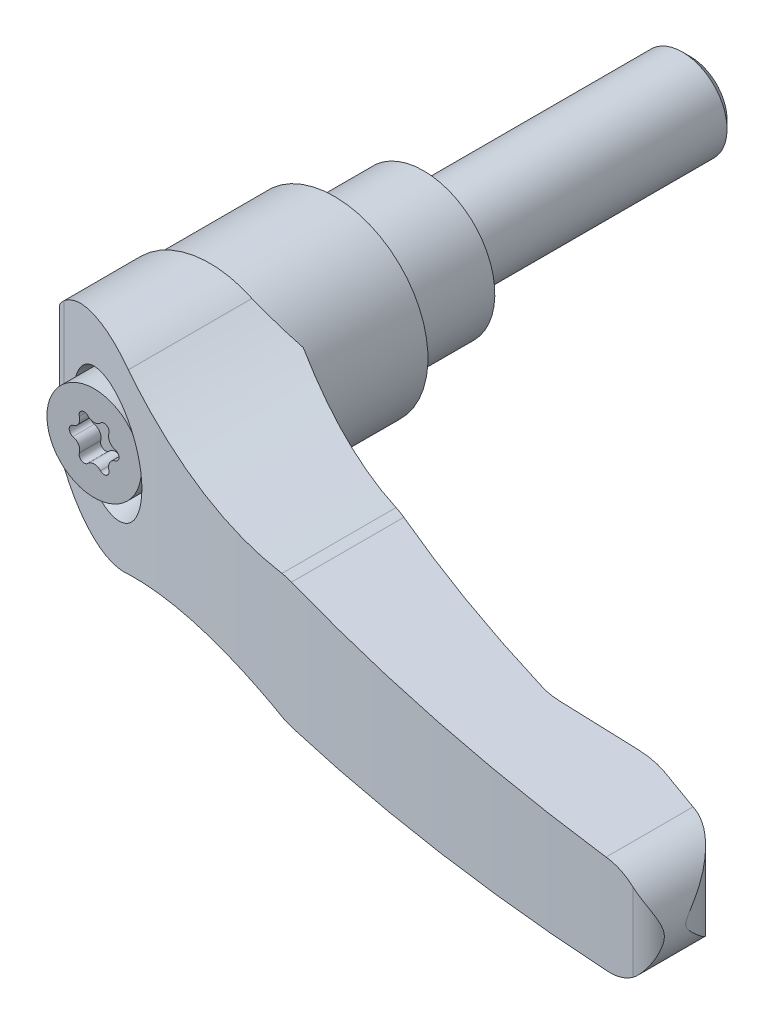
ISO-10303-21;
HEADER;
FILE_DESCRIPTION(('STEP AP214'),'2;1');
FILE_NAME('part.step','',(''),(''),'','','');
FILE_SCHEMA(('AUTOMOTIVE_DESIGN { 1 0 10303 214 1 1 1 1 }'));
ENDSEC;
DATA;
#1=APPLICATION_CONTEXT('core data for automotive mechanical design processes');
#2=APPLICATION_PROTOCOL_DEFINITION('international standard','automotive_design',2000,#1);
#3=PRODUCT_CONTEXT('',#1,'mechanical');
#4=PRODUCT('Part','Part','',(#3));
#5=PRODUCT_RELATED_PRODUCT_CATEGORY('part','',(#4));
#6=PRODUCT_DEFINITION_FORMATION('','',#4);
#7=PRODUCT_DEFINITION_CONTEXT('part definition',#1,'design');
#8=PRODUCT_DEFINITION('design','',#6,#7);
#9=PRODUCT_DEFINITION_SHAPE('','',#8);
#10=(LENGTH_UNIT() NAMED_UNIT(*) SI_UNIT(.MILLI.,.METRE.));
#11=(NAMED_UNIT(*) PLANE_ANGLE_UNIT() SI_UNIT($,.RADIAN.));
#12=(NAMED_UNIT(*) SI_UNIT($,.STERADIAN.) SOLID_ANGLE_UNIT());
#13=UNCERTAINTY_MEASURE_WITH_UNIT(LENGTH_MEASURE(1.E-05),#10,'distance_accuracy_value','');
#14=(GEOMETRIC_REPRESENTATION_CONTEXT(3) GLOBAL_UNCERTAINTY_ASSIGNED_CONTEXT((#13)) GLOBAL_UNIT_ASSIGNED_CONTEXT((#10,
#11,#12)) REPRESENTATION_CONTEXT('',''));
#15=CARTESIAN_POINT('',(0.,0.,0.));
#16=DIRECTION('',(0.,0.,1.));
#17=DIRECTION('',(1.,0.,0.));
#18=AXIS2_PLACEMENT_3D('',#15,#16,#17);
#19=CARTESIAN_POINT('',(0.,0.,-9.53924875));
#20=DIRECTION('',(0.,0.,-1.));
#21=DIRECTION('',(0.,1.,0.));
#22=AXIS2_PLACEMENT_3D('',#19,#20,#21);
#23=CYLINDRICAL_SURFACE('',#22,5.);
#24=CARTESIAN_POINT('',(0.,0.,-29.08));
#25=DIRECTION('',(0.,0.,-1.));
#26=DIRECTION('',(0.,1.,0.));
#27=AXIS2_PLACEMENT_3D('',#24,#25,#26);
#28=CIRCLE('',#27,5.);
#29=CARTESIAN_POINT('',(0.,5.,-29.08));
#30=VERTEX_POINT('',#29);
#31=EDGE_CURVE('E9',#30,#30,#28,.F.);
#32=ORIENTED_EDGE('',*,*,#31,.T.);
#33=EDGE_LOOP('',(#32));
#34=FACE_BOUND('',#33,.T.);
#35=CARTESIAN_POINT('',(0.,0.,0.));
#36=DIRECTION('',(0.,0.,-1.));
#37=DIRECTION('',(0.,1.,0.));
#38=AXIS2_PLACEMENT_3D('',#35,#36,#37);
#39=CIRCLE('',#38,5.);
#40=CARTESIAN_POINT('',(0.,5.,0.));
#41=VERTEX_POINT('',#40);
#42=EDGE_CURVE('E616',#41,#41,#39,.F.);
#43=ORIENTED_EDGE('',*,*,#42,.F.);
#44=EDGE_LOOP('',(#43));
#45=FACE_BOUND('',#44,.T.);
#46=ADVANCED_FACE('F14',(#34,#45),#23,.T.);
#47=CARTESIAN_POINT('',(6.5,0.,0.));
#48=DIRECTION('',(0.,0.,-1.));
#49=DIRECTION('',(0.,1.,0.));
#50=AXIS2_PLACEMENT_3D('',#47,#48,#49);
#51=PLANE('',#50);
#52=ORIENTED_EDGE('',*,*,#42,.T.);
#53=EDGE_LOOP('',(#52));
#54=FACE_BOUND('',#53,.T.);
#55=CARTESIAN_POINT('',(0.,0.,0.));
#56=DIRECTION('',(0.,0.,-1.));
#57=DIRECTION('',(0.,1.,0.));
#58=AXIS2_PLACEMENT_3D('',#55,#56,#57);
#59=CIRCLE('',#58,8.);
#60=CARTESIAN_POINT('',(0.,8.,0.));
#61=VERTEX_POINT('',#60);
#62=EDGE_CURVE('E699',#61,#61,#59,.F.);
#63=ORIENTED_EDGE('',*,*,#62,.F.);
#64=EDGE_LOOP('',(#63));
#65=FACE_BOUND('',#64,.T.);
#66=ADVANCED_FACE('F496',(#54,#65),#51,.T.);
#67=CARTESIAN_POINT('',(0.,0.,11.15));
#68=DIRECTION('',(0.,0.,-1.));
#69=DIRECTION('',(0.,1.,0.));
#70=AXIS2_PLACEMENT_3D('',#67,#68,#69);
#71=CYLINDRICAL_SURFACE('',#70,8.);
#72=ORIENTED_EDGE('',*,*,#62,.T.);
#73=EDGE_LOOP('',(#72));
#74=FACE_BOUND('',#73,.T.);
#75=CARTESIAN_POINT('',(0.,0.,10.7));
#76=DIRECTION('',(0.,0.,-1.));
#77=DIRECTION('',(1.,0.,0.));
#78=AXIS2_PLACEMENT_3D('',#75,#76,#77);
#79=CIRCLE('',#78,8.);
#80=CARTESIAN_POINT('',(8.,0.,10.7));
#81=VERTEX_POINT('',#80);
#82=EDGE_CURVE('E609',#81,#81,#79,.T.);
#83=ORIENTED_EDGE('',*,*,#82,.T.);
#84=EDGE_LOOP('',(#83));
#85=FACE_BOUND('',#84,.T.);
#86=ADVANCED_FACE('F487',(#74,#85),#71,.T.);
#87=CARTESIAN_POINT('',(0.,0.,10.4));
#88=DIRECTION('',(0.,0.,-1.));
#89=DIRECTION('',(0.,1.,0.));
#90=AXIS2_PLACEMENT_3D('',#87,#88,#89);
#91=CONICAL_SURFACE('',#90,8.3,0.785398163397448);
#92=ORIENTED_EDGE('',*,*,#82,.F.);
#93=EDGE_LOOP('',(#92));
#94=FACE_BOUND('',#93,.T.);
#95=CARTESIAN_POINT('',(0.,0.,10.4));
#96=DIRECTION('',(0.,0.,-1.));
#97=DIRECTION('',(0.,1.,0.));
#98=AXIS2_PLACEMENT_3D('',#95,#96,#97);
#99=CIRCLE('',#98,8.3);
#100=CARTESIAN_POINT('',(0.,8.3,10.4));
#101=VERTEX_POINT('',#100);
#102=EDGE_CURVE('E605',#101,#101,#99,.T.);
#103=ORIENTED_EDGE('',*,*,#102,.T.);
#104=EDGE_LOOP('',(#103));
#105=FACE_BOUND('',#104,.T.);
#106=ADVANCED_FACE('F483',(#94,#105),#91,.F.);
#107=CARTESIAN_POINT('',(0.,0.,9.7));
#108=DIRECTION('',(0.,0.,-1.));
#109=DIRECTION('',(0.,1.,0.));
#110=AXIS2_PLACEMENT_3D('',#107,#108,#109);
#111=CYLINDRICAL_SURFACE('',#110,8.3);
#112=ORIENTED_EDGE('',*,*,#102,.F.);
#113=EDGE_LOOP('',(#112));
#114=FACE_BOUND('',#113,.T.);
#115=CARTESIAN_POINT('',(0.,0.,10.));
#116=DIRECTION('',(0.,0.,-1.));
#117=DIRECTION('',(0.,1.,0.));
#118=AXIS2_PLACEMENT_3D('',#115,#116,#117);
#119=CIRCLE('',#118,8.3);
#120=CARTESIAN_POINT('',(0.,8.3,10.));
#121=VERTEX_POINT('',#120);
#122=EDGE_CURVE('E608',#121,#121,#119,.F.);
#123=ORIENTED_EDGE('',*,*,#122,.F.);
#124=EDGE_LOOP('',(#123));
#125=FACE_BOUND('',#124,.T.);
#126=ADVANCED_FACE('F479',(#114,#125),#111,.F.);
#127=CARTESIAN_POINT('',(-5.26,0.,10.));
#128=DIRECTION('',(0.,0.,-1.));
#129=DIRECTION('',(0.,1.,0.));
#130=AXIS2_PLACEMENT_3D('',#127,#128,#129);
#131=PLANE('',#130);
#132=CARTESIAN_POINT('',(-0.00999999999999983,0.,10.));
#133=DIRECTION('',(0.,0.,1.));
#134=DIRECTION('',(-1.,0.,0.));
#135=AXIS2_PLACEMENT_3D('',#132,#133,#134);
#136=CIRCLE('',#135,10.5);
#137=CARTESIAN_POINT('',(-10.2600377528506,-2.27743848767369,10.));
#138=VERTEX_POINT('',#137);
#139=CARTESIAN_POINT('',(-10.2600377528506,2.27743848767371,10.));
#140=VERTEX_POINT('',#139);
#141=EDGE_CURVE('E707',#138,#140,#136,.T.);
#142=ORIENTED_EDGE('',*,*,#141,.F.);
#143=DIRECTION('',(0.,-1.,0.));
#144=VECTOR('',#143,1.);
#145=CARTESIAN_POINT('',(-10.2600377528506,-22.,10.));
#146=LINE('',#145,#144);
#147=EDGE_CURVE('E706',#138,#140,#146,.F.);
#148=ORIENTED_EDGE('',*,*,#147,.T.);
#149=EDGE_LOOP('',(#142,#148));
#150=FACE_BOUND('',#149,.T.);
#151=ORIENTED_EDGE('',*,*,#122,.T.);
#152=EDGE_LOOP('',(#151));
#153=FACE_BOUND('',#152,.T.);
#154=ADVANCED_FACE('F475',(#150,#153),#131,.T.);
#155=CARTESIAN_POINT('',(-10.2600377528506,-22.,10.));
#156=DIRECTION('',(0.707106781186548,0.,0.707106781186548));
#157=DIRECTION('',(-0.707106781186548,0.,0.707106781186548));
#158=AXIS2_PLACEMENT_3D('',#155,#156,#157);
#159=PLANE('',#158);
#160=ORIENTED_EDGE('',*,*,#147,.F.);
#161=CARTESIAN_POINT('',(-0.00999999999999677,0.,-0.250037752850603));
#162=DIRECTION('',(0.707106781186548,0.,0.707106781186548));
#163=DIRECTION('',(-0.707106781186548,0.,0.707106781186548));
#164=AXIS2_PLACEMENT_3D('',#161,#162,#163);
#165=ELLIPSE('',#164,14.8492424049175,10.5);
#166=EDGE_CURVE('E709',#140,#138,#165,.T.);
#167=ORIENTED_EDGE('',*,*,#166,.F.);
#168=EDGE_LOOP('',(#160,#167));
#169=FACE_BOUND('',#168,.T.);
#170=ADVANCED_FACE('F471',(#169),#159,.F.);
#171=CARTESIAN_POINT('',(-0.0100000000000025,0.,18.90625));
#172=DIRECTION('',(0.,0.,1.));
#173=DIRECTION('',(-1.,0.,0.));
#174=AXIS2_PLACEMENT_3D('',#171,#172,#173);
#175=CYLINDRICAL_SURFACE('',#174,10.5);
#176=CARTESIAN_POINT('',(-0.010000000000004,0.,24.));
#177=DIRECTION('',(0.,0.,1.));
#178=DIRECTION('',(-1.,0.,0.));
#179=AXIS2_PLACEMENT_3D('',#176,#177,#178);
#180=CIRCLE('',#179,10.5);
#181=CARTESIAN_POINT('',(-10.51,0.,24.));
#182=VERTEX_POINT('',#181);
#183=CARTESIAN_POINT('',(10.49,0.,24.));
#184=VERTEX_POINT('',#183);
#185=EDGE_CURVE('E456',#182,#184,#180,.T.);
#186=ORIENTED_EDGE('',*,*,#185,.F.);
#187=CARTESIAN_POINT('',(-0.010000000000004,0.,24.));
#188=DIRECTION('',(0.,0.,1.));
#189=DIRECTION('',(-1.,0.,0.));
#190=AXIS2_PLACEMENT_3D('',#187,#188,#189);
#191=CIRCLE('',#190,10.5);
#192=EDGE_CURVE('E591',#184,#182,#191,.T.);
#193=ORIENTED_EDGE('',*,*,#192,.F.);
#194=EDGE_LOOP('',(#186,#193));
#195=FACE_BOUND('',#194,.T.);
#196=ORIENTED_EDGE('',*,*,#141,.T.);
#197=ORIENTED_EDGE('',*,*,#166,.T.);
#198=EDGE_LOOP('',(#196,#197));
#199=FACE_BOUND('',#198,.T.);
#200=ADVANCED_FACE('F467',(#195,#199),#175,.T.);
#201=CARTESIAN_POINT('',(-10.51,-12.,24.));
#202=DIRECTION('',(0.,0.,-1.));
#203=DIRECTION('',(0.,1.,0.));
#204=AXIS2_PLACEMENT_3D('',#201,#202,#203);
#205=PLANE('',#204);
#206=ORIENTED_EDGE('',*,*,#185,.T.);
#207=DIRECTION('',(0.,-1.,0.));
#208=VECTOR('',#207,1.);
#209=CARTESIAN_POINT('',(10.4900000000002,-12.,23.9999999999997));
#210=LINE('',#209,#208);
#211=CARTESIAN_POINT('',(10.4900000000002,-8.03465812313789,24.));
#212=VERTEX_POINT('',#211);
#213=EDGE_CURVE('E442',#184,#212,#210,.T.);
#214=ORIENTED_EDGE('',*,*,#213,.T.);
#215=CARTESIAN_POINT('',(22.94,-55.53,24.));
#216=DIRECTION('',(0.,0.,1.));
#217=DIRECTION('',(0.,-1.,0.));
#218=AXIS2_PLACEMENT_3D('',#215,#216,#217);
#219=CIRCLE('',#218,49.1);
#220=CARTESIAN_POINT('',(4.72251026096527,-9.93468151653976,24.));
#221=VERTEX_POINT('',#220);
#222=EDGE_CURVE('E746',#212,#221,#219,.T.);
#223=ORIENTED_EDGE('',*,*,#222,.T.);
#224=CARTESIAN_POINT('',(0.,0.,24.));
#225=DIRECTION('',(0.,0.,1.));
#226=DIRECTION('',(0.,-1.,0.));
#227=AXIS2_PLACEMENT_3D('',#224,#225,#226);
#228=CIRCLE('',#227,11.);
#229=CARTESIAN_POINT('',(-10.51,-3.24652121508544,24.));
#230=VERTEX_POINT('',#229);
#231=EDGE_CURVE('E740',#230,#221,#228,.T.);
#232=ORIENTED_EDGE('',*,*,#231,.F.);
#233=DIRECTION('',(0.,-1.,0.));
#234=VECTOR('',#233,1.);
#235=CARTESIAN_POINT('',(-10.51,-12.,24.));
#236=LINE('',#235,#234);
#237=EDGE_CURVE('E590',#182,#230,#236,.T.);
#238=ORIENTED_EDGE('',*,*,#237,.F.);
#239=EDGE_LOOP('',(#206,#214,#223,#232,#238));
#240=FACE_BOUND('',#239,.T.);
#241=ADVANCED_FACE('F462',(#240),#205,.T.);
#242=CARTESIAN_POINT('',(31.3589689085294,0.945932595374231,54.5));
#243=DIRECTION('',(0.,0.,1.));
#244=DIRECTION('',(0.,-1.,0.));
#245=AXIS2_PLACEMENT_3D('',#242,#243,#244);
#246=CYLINDRICAL_SURFACE('',#245,8.00000000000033);
#247=CARTESIAN_POINT('',(31.6479325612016,-7.04884695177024,46.4731806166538));
#248=CARTESIAN_POINT('',(31.4018180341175,-7.05768532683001,46.4087993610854));
#249=CARTESIAN_POINT('',(31.1563854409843,-7.05525330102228,46.3442255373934));
#250=CARTESIAN_POINT('',(30.66688412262,-7.02784844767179,46.2146927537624));
#251=CARTESIAN_POINT('',(30.4228153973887,-7.00287562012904,46.1497337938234));
#252=CARTESIAN_POINT('',(30.1794286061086,-6.96663239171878,46.0845822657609));
#253=B_SPLINE_CURVE_WITH_KNOTS('',3,(#247,#248,#249,#250,#251,#252),.UNSPECIFIED.,.F.,.F.,(4,2,
4),(0.,0.76139061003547,1.52278122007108),.UNSPECIFIED.);
#254=CARTESIAN_POINT('',(31.6479325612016,-7.04884695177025,46.4731806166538));
#255=VERTEX_POINT('',#254);
#256=CARTESIAN_POINT('',(30.1794286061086,-6.96663239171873,46.084582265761));
#257=VERTEX_POINT('',#256);
#258=EDGE_CURVE('E449',#255,#257,#253,.T.);
#259=ORIENTED_EDGE('',*,*,#258,.T.);
#260=DIRECTION('',(0.,0.,1.));
#261=VECTOR('',#260,1.);
#262=CARTESIAN_POINT('',(30.1794286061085,-6.96663239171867,54.5));
#263=LINE('',#262,#261);
#264=CARTESIAN_POINT('',(30.1794286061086,-6.96663239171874,33.2732494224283));
#265=VERTEX_POINT('',#264);
#266=EDGE_CURVE('E741',#257,#265,#263,.F.);
#267=ORIENTED_EDGE('',*,*,#266,.T.);
#268=CARTESIAN_POINT('',(30.1794286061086,-6.9666323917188,33.2732494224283));
#269=CARTESIAN_POINT('',(30.4222007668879,-7.00282816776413,33.3728739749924));
#270=CARTESIAN_POINT('',(30.6665043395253,-7.02781937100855,33.4725985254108));
#271=CARTESIAN_POINT('',(31.0339219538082,-7.04840105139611,33.6217860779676));
#272=CARTESIAN_POINT('',(31.1565128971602,-7.05244559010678,33.6714318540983));
#273=CARTESIAN_POINT('',(31.4020580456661,-7.05489552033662,33.7706062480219));
#274=CARTESIAN_POINT('',(31.5250125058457,-7.05329063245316,33.8201344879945));
#275=CARTESIAN_POINT('',(31.6479325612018,-7.04884695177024,33.8695155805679));
#276=B_SPLINE_CURVE_WITH_KNOTS('',3,(#268,#269,#270,#271,#272,#273,#274,#275),.UNSPECIFIED.,.F.,
.F.,(4,2,2,4),(0.,0.794258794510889,1.19111760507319,1.58869889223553),.UNSPECIFIED.);
#277=CARTESIAN_POINT('',(31.6479325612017,-7.04884695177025,33.8695155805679));
#278=VERTEX_POINT('',#277);
#279=EDGE_CURVE('E444',#265,#278,#276,.T.);
#280=ORIENTED_EDGE('',*,*,#279,.T.);
#281=DIRECTION('',(0.,0.,1.));
#282=VECTOR('',#281,1.);
#283=CARTESIAN_POINT('',(31.6479325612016,-7.04884695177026,54.5));
#284=LINE('',#283,#282);
#285=EDGE_CURVE('E751',#278,#255,#284,.T.);
#286=ORIENTED_EDGE('',*,*,#285,.T.);
#287=EDGE_LOOP('',(#259,#267,#280,#286));
#288=FACE_BOUND('',#287,.T.);
#289=ADVANCED_FACE('F458',(#288),#246,.T.);
#290=CARTESIAN_POINT('',(79.9967051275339,-12.,50.5395921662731));
#291=DIRECTION('',(0.992331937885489,0.,-0.123601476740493));
#292=DIRECTION('',(0.123601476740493,0.,0.992331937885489));
#293=AXIS2_PLACEMENT_3D('',#290,#291,#292);
#294=PLANE('',#293);
#295=CARTESIAN_POINT('',(79.9967051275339,-0.190348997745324,50.5395921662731));
#296=CARTESIAN_POINT('',(79.9969785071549,-0.182455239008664,50.5417867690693));
#297=CARTESIAN_POINT('',(79.9972360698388,-0.174525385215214,50.543854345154));
#298=CARTESIAN_POINT('',(79.9977166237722,-0.158664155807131,50.5477118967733));
#299=CARTESIAN_POINT('',(79.9979398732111,-0.150733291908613,50.5495039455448));
#300=CARTESIAN_POINT('',(79.9983518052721,-0.134870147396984,50.5528105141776));
#301=CARTESIAN_POINT('',(79.998540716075,-0.12693825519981,50.5543268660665));
#302=CARTESIAN_POINT('',(79.9988840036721,-0.111073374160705,50.5570823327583));
#303=CARTESIAN_POINT('',(79.9990385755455,-0.103140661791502,50.5583230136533));
#304=CARTESIAN_POINT('',(79.9993132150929,-0.087274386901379,50.5605274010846));
#305=CARTESIAN_POINT('',(79.9994334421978,-0.0793410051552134,50.5614923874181));
#306=CARTESIAN_POINT('',(79.9996394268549,-0.0634736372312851,50.5631456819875));
#307=CARTESIAN_POINT('',(79.9997253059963,-0.0555397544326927,50.5638349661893));
#308=CARTESIAN_POINT('',(79.9998626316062,-0.0396716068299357,50.5649371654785));
#309=CARTESIAN_POINT('',(79.9999141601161,-0.0317373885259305,50.5653507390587));
#310=CARTESIAN_POINT('',(79.9999828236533,-0.0158687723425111,50.5659018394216));
#311=CARTESIAN_POINT('',(80.,-0.00793438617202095,50.5660396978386));
#312=CARTESIAN_POINT('',(80.,0.00793438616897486,50.5660396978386));
#313=CARTESIAN_POINT('',(79.9999828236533,0.0158687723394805,50.5659018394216));
#314=CARTESIAN_POINT('',(79.9999141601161,0.0317373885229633,50.5653507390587));
#315=CARTESIAN_POINT('',(79.9998626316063,0.0396716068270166,50.5649371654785));
#316=CARTESIAN_POINT('',(79.9997253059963,0.0555397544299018,50.5638349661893));
#317=CARTESIAN_POINT('',(79.9996394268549,0.0634736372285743,50.5631456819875));
#318=CARTESIAN_POINT('',(79.9994334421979,0.0793410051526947,50.5614923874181));
#319=CARTESIAN_POINT('',(79.9993132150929,0.0872743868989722,50.5605274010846));
#320=CARTESIAN_POINT('',(79.9990385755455,0.103140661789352,50.5583230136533));
#321=CARTESIAN_POINT('',(79.9988840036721,0.111073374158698,50.5570823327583));
#322=CARTESIAN_POINT('',(79.998540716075,0.126938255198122,50.5543268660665));
#323=CARTESIAN_POINT('',(79.9983518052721,0.134870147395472,50.5528105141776));
#324=CARTESIAN_POINT('',(79.9979398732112,0.150733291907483,50.5495039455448));
#325=CARTESIAN_POINT('',(79.9977166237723,0.158664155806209,50.5477118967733));
#326=CARTESIAN_POINT('',(79.9972360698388,0.174525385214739,50.543854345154));
#327=CARTESIAN_POINT('',(79.9969785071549,0.182455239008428,50.5417867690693));
#328=CARTESIAN_POINT('',(79.9967051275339,0.190348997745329,50.5395921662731));
#329=B_SPLINE_CURVE_WITH_KNOTS('',3,(#295,#296,#297,#298,#299,#300,#301,#302,#303,#304,#305,
#306,#307,#308,#309,#310,#311,#312,#313,#314,#315,#316,#317,#318,#319,#320,#321,#322,#323,#324,
#325,#326,#327,#328),.UNSPECIFIED.,.F.,.F.,(4,2,2,2,2,2,2,2,2,2,2,2,2,2,2,2,4),(0.,
0.0245923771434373,0.0489895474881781,0.0732181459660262,0.0973053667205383,0.121278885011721,
0.145166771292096,0.168997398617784,0.19279934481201,0.216601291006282,0.240431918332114,
0.264319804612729,0.288293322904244,0.312380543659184,0.336609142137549,0.361006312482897,
0.385598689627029),.UNSPECIFIED.);
#330=CARTESIAN_POINT('',(79.9967051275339,-0.190348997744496,50.5395921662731));
#331=VERTEX_POINT('',#330);
#332=CARTESIAN_POINT('',(79.9967051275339,0.190348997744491,50.5395921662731));
#333=VERTEX_POINT('',#332);
#334=EDGE_CURVE('E370',#331,#333,#329,.T.);
#335=ORIENTED_EDGE('',*,*,#334,.F.);
#336=DIRECTION('',(0.,-1.,0.));
#337=VECTOR('',#336,1.);
#338=CARTESIAN_POINT('',(79.9967051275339,-12.,50.5395921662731));
#339=LINE('',#338,#337);
#340=EDGE_CURVE('E455',#333,#331,#339,.T.);
#341=ORIENTED_EDGE('',*,*,#340,.F.);
#342=EDGE_LOOP('',(#335,#341));
#343=FACE_BOUND('',#342,.T.);
#344=ADVANCED_FACE('F399',(#343),#294,.T.);
#345=CARTESIAN_POINT('',(72.6137555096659,-12.,51.4591871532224));
#346=DIRECTION('',(0.,-1.,0.));
#347=DIRECTION('',(1.,0.,0.));
#348=AXIS2_PLACEMENT_3D('',#345,#346,#347);
#349=CYLINDRICAL_SURFACE('',#348,7.44);
#350=CARTESIAN_POINT('',(79.9967051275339,0.190348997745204,50.5395921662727));
#351=CARTESIAN_POINT('',(79.9951469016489,0.235214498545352,50.5270575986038));
#352=CARTESIAN_POINT('',(79.9930953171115,0.27873685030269,50.5108629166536));
#353=CARTESIAN_POINT('',(79.988164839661,0.363077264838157,50.4732708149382));
#354=CARTESIAN_POINT('',(79.9852922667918,0.40391316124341,50.4519133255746));
#355=CARTESIAN_POINT('',(79.975702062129,0.52245816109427,50.3833482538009));
#356=CARTESIAN_POINT('',(79.9679715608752,0.597169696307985,50.3312876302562));
#357=CARTESIAN_POINT('',(79.9508869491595,0.736456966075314,50.2251559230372));
#358=CARTESIAN_POINT('',(79.9416856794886,0.801375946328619,50.1714851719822));
#359=CARTESIAN_POINT('',(79.9214540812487,0.928420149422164,50.0612288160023));
#360=CARTESIAN_POINT('',(79.9104232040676,0.990544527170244,50.0046423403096));
#361=CARTESIAN_POINT('',(79.8746515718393,1.17419942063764,49.8323129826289));
#362=CARTESIAN_POINT('',(79.8472488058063,1.29287988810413,49.7141099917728));
#363=CARTESIAN_POINT('',(79.7848398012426,1.52823594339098,49.4729704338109));
#364=CARTESIAN_POINT('',(79.7496926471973,1.64482416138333,49.3499864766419));
#365=CARTESIAN_POINT('',(79.6721004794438,1.87458318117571,49.1033284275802));
#366=CARTESIAN_POINT('',(79.6296610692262,1.98775652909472,48.9796549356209));
#367=CARTESIAN_POINT('',(79.5033816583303,2.29352791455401,48.6415502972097));
#368=CARTESIAN_POINT('',(79.4120558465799,2.48329449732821,48.427296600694));
#369=CARTESIAN_POINT('',(79.2061355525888,2.85434488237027,48.0023120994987));
#370=CARTESIAN_POINT('',(79.0915236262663,3.03562219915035,47.7915840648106));
#371=CARTESIAN_POINT('',(78.8390032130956,3.38665877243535,47.3777391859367));
#372=CARTESIAN_POINT('',(78.7012752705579,3.5564939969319,47.1745772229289));
#373=CARTESIAN_POINT('',(78.4009143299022,3.88356808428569,46.7768350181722));
#374=CARTESIAN_POINT('',(78.2383021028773,4.04081728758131,46.5822477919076));
#375=CARTESIAN_POINT('',(77.9568022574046,4.2801698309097,46.2794503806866));
#376=CARTESIAN_POINT('',(77.8461272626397,4.36735584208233,46.1675710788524));
#377=CARTESIAN_POINT('',(77.61512986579,4.53501217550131,45.9487274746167));
#378=CARTESIAN_POINT('',(77.494805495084,4.61548112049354,45.8417641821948));
#379=CARTESIAN_POINT('',(77.2447591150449,4.7684092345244,45.6339165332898));
#380=CARTESIAN_POINT('',(77.1150589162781,4.84088606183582,45.5330190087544));
#381=CARTESIAN_POINT('',(76.8461728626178,4.97676025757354,45.3380932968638));
#382=CARTESIAN_POINT('',(76.7069926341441,5.04016294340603,45.2440611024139));
#383=CARTESIAN_POINT('',(76.4438690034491,5.14664435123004,45.0792448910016));
#384=CARTESIAN_POINT('',(76.3213555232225,5.19134589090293,45.0072256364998));
#385=CARTESIAN_POINT('',(76.0703754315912,5.27269544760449,44.8693561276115));
#386=CARTESIAN_POINT('',(75.9419112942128,5.30934677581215,44.8035033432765));
#387=CARTESIAN_POINT('',(75.678496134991,5.37397975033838,44.6781572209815));
#388=CARTESIAN_POINT('',(75.5435027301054,5.40189236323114,44.6187168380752));
#389=CARTESIAN_POINT('',(75.2686009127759,5.44782102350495,44.507386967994));
#390=CARTESIAN_POINT('',(75.1286862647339,5.46582399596,44.4555075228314));
#391=CARTESIAN_POINT('',(74.9868127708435,5.47841339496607,44.407790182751));
#392=B_SPLINE_CURVE_WITH_KNOTS('',3,(#350,#351,#352,#353,#354,#355,#356,#357,#358,#359,#360,
#361,#362,#363,#364,#365,#366,#367,#368,#369,#370,#371,#372,#373,#374,#375,#376,#377,#378,#379,
#380,#381,#382,#383,#384,#385,#386,#387,#388,#389,#390,#391),.UNSPECIFIED.,.F.,.F.,(4,2,2,2,2,2,
2,2,2,2,2,2,2,2,2,2,2,2,2,2,4),(0.,0.139245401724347,0.277446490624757,0.550810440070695,
0.804906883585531,1.05907965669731,1.56794086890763,2.08696422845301,2.60559053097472,
3.50582150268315,4.40672935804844,5.30090298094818,6.1943342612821,6.73367946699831,
7.27313498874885,7.81137365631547,8.3492956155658,8.79580649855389,9.24213337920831,
9.69190199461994,10.1422626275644),.UNSPECIFIED.);
#393=CARTESIAN_POINT('',(74.9868127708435,5.47841339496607,44.407790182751));
#394=VERTEX_POINT('',#393);
#395=EDGE_CURVE('E387',#333,#394,#392,.T.);
#396=ORIENTED_EDGE('',*,*,#395,.F.);
#397=ORIENTED_EDGE('',*,*,#340,.T.);
#398=CARTESIAN_POINT('',(74.9868127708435,-5.47841339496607,44.407790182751));
#399=CARTESIAN_POINT('',(75.1398120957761,-5.46484028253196,44.459242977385));
#400=CARTESIAN_POINT('',(75.2905169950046,-5.44496899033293,44.5155387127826));
#401=CARTESIAN_POINT('',(75.5860882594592,-5.39377415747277,44.6368581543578));
#402=CARTESIAN_POINT('',(75.7309637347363,-5.36246932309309,44.7018674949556));
#403=CARTESIAN_POINT('',(76.0125967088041,-5.28989557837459,44.8390817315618));
#404=CARTESIAN_POINT('',(76.1494251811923,-5.24873835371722,44.9112009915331));
#405=CARTESIAN_POINT('',(76.4161065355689,-5.15736483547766,45.0623731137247));
#406=CARTESIAN_POINT('',(76.5459558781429,-5.10714400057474,45.1414294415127));
#407=CARTESIAN_POINT('',(76.8276536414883,-4.98604991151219,45.3247681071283));
#408=CARTESIAN_POINT('',(76.9775772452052,-4.91309116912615,45.4306358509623));
#409=CARTESIAN_POINT('',(77.265789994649,-4.75681575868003,45.6501400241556));
#410=CARTESIAN_POINT('',(77.4040776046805,-4.67349772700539,45.7637774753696));
#411=CARTESIAN_POINT('',(77.8028296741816,-4.40945601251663,46.1156758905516));
#412=CARTESIAN_POINT('',(78.0457801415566,-4.21527563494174,46.3639882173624));
#413=CARTESIAN_POINT('',(78.417694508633,-3.86589184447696,46.7984433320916));
#414=CARTESIAN_POINT('',(78.5586476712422,-3.71726415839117,46.9799982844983));
#415=CARTESIAN_POINT('',(78.8199419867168,-3.41009407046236,47.3496806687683));
#416=CARTESIAN_POINT('',(78.940273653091,-3.25154715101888,47.537811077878));
#417=CARTESIAN_POINT('',(79.1607378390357,-2.92676895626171,47.9181651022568));
#418=CARTESIAN_POINT('',(79.2609186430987,-2.76055725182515,48.1103776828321));
#419=CARTESIAN_POINT('',(79.4421677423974,-2.42115236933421,48.4974286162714));
#420=CARTESIAN_POINT('',(79.5232445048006,-2.24796232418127,48.692265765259));
#421=CARTESIAN_POINT('',(79.6578968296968,-1.91676087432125,49.0578102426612));
#422=CARTESIAN_POINT('',(79.7136489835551,-1.75958096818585,49.2284695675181));
#423=CARTESIAN_POINT('',(79.786963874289,-1.51825146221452,49.4826945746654));
#424=CARTESIAN_POINT('',(79.8097141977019,-1.43673320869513,49.567289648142));
#425=CARTESIAN_POINT('',(79.8517302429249,-1.27132927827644,49.7350141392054));
#426=CARTESIAN_POINT('',(79.870996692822,-1.18744410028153,49.8181438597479));
#427=CARTESIAN_POINT('',(79.9071865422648,-1.01046435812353,49.9869732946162));
#428=CARTESIAN_POINT('',(79.9238666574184,-0.917129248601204,50.0724723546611));
#429=CARTESIAN_POINT('',(79.9529450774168,-0.724505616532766,50.2358460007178));
#430=CARTESIAN_POINT('',(79.9653823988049,-0.625281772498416,50.3137850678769));
#431=CARTESIAN_POINT('',(79.9802376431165,-0.468580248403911,50.4153149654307));
#432=CARTESIAN_POINT('',(79.9845030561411,-0.416215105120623,50.4460963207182));
#433=CARTESIAN_POINT('',(79.9917045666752,-0.30687937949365,50.4998809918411));
#434=CARTESIAN_POINT('',(79.9946243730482,-0.249861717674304,50.5227881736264));
#435=CARTESIAN_POINT('',(79.9967051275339,-0.190348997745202,50.5395921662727));
#436=B_SPLINE_CURVE_WITH_KNOTS('',3,(#398,#399,#400,#401,#402,#403,#404,#405,#406,#407,#408,
#409,#410,#411,#412,#413,#414,#415,#416,#417,#418,#419,#420,#421,#422,#423,#424,#425,#426,#427,
#428,#429,#430,#431,#432,#433,#434,#435),.UNSPECIFIED.,.F.,.F.,(4,2,2,2,2,2,2,2,2,2,2,2,2,2,2,2,
2,2,4),(0.,0.485611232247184,0.970431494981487,1.44999646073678,1.92980238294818,
2.52141817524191,3.11311192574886,4.30183389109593,5.12208341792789,5.94270927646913,
6.76134473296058,7.57961667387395,8.29494630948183,8.65387747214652,9.01273353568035,
9.39561932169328,9.77488268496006,9.95698827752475,10.141244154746),.UNSPECIFIED.);
#437=CARTESIAN_POINT('',(74.9868127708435,-5.47841339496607,44.407790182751));
#438=VERTEX_POINT('',#437);
#439=EDGE_CURVE('E359',#438,#331,#436,.T.);
#440=ORIENTED_EDGE('',*,*,#439,.F.);
#441=DIRECTION('',(0.,-1.,0.));
#442=VECTOR('',#441,1.);
#443=CARTESIAN_POINT('',(74.9868127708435,-12.,44.407790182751));
#444=LINE('',#443,#442);
#445=EDGE_CURVE('E443',#394,#438,#444,.T.);
#446=ORIENTED_EDGE('',*,*,#445,.F.);
#447=EDGE_LOOP('',(#396,#397,#440,#446));
#448=FACE_BOUND('',#447,.T.);
#449=ADVANCED_FACE('F393',(#448),#349,.T.);
#450=CARTESIAN_POINT('',(57.3760512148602,-12.,33.47));
#451=DIRECTION('',(0.,-1.,0.));
#452=DIRECTION('',(1.,0.,0.));
#453=AXIS2_PLACEMENT_3D('',#450,#451,#452);
#454=CYLINDRICAL_SURFACE('',#453,8.58999999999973);
#455=DIRECTION('',(0.,-1.,0.));
#456=VECTOR('',#455,1.);
#457=CARTESIAN_POINT('',(55.1138126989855,-12.,41.756759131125));
#458=LINE('',#457,#456);
#459=CARTESIAN_POINT('',(55.1138126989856,-6.20069518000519,41.7567591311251));
#460=VERTEX_POINT('',#459);
#461=CARTESIAN_POINT('',(55.1138126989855,6.2006951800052,41.7567591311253));
#462=VERTEX_POINT('',#461);
#463=EDGE_CURVE('E735',#460,#462,#458,.F.);
#464=ORIENTED_EDGE('',*,*,#463,.T.);
#465=CARTESIAN_POINT('',(57.3760512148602,6.11892873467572,33.47));
#466=DIRECTION('',(-0.0361204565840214,-0.999347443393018,0.));
#467=DIRECTION('',(0.999347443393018,-0.0361204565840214,0.));
#468=AXIS2_PLACEMENT_3D('',#465,#466,#467);
#469=ELLIPSE('',#468,8.59560912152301,8.58999999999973);
#470=CARTESIAN_POINT('',(57.3760512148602,6.11892873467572,42.06));
#471=VERTEX_POINT('',#470);
#472=EDGE_CURVE('E816',#462,#471,#469,.F.);
#473=ORIENTED_EDGE('',*,*,#472,.T.);
#474=DIRECTION('',(0.,1.,0.));
#475=VECTOR('',#474,1.);
#476=CARTESIAN_POINT('',(57.3760512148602,-12.,42.06));
#477=LINE('',#476,#475);
#478=CARTESIAN_POINT('',(57.3760512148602,-6.11892873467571,42.06));
#479=VERTEX_POINT('',#478);
#480=EDGE_CURVE('E596',#479,#471,#477,.T.);
#481=ORIENTED_EDGE('',*,*,#480,.F.);
#482=CARTESIAN_POINT('',(57.3760512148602,-6.11892873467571,33.47));
#483=DIRECTION('',(-0.0361204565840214,0.999347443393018,0.));
#484=DIRECTION('',(-0.999347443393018,-0.0361204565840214,0.));
#485=AXIS2_PLACEMENT_3D('',#482,#483,#484);
#486=ELLIPSE('',#485,8.59560912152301,8.58999999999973);
#487=EDGE_CURVE('E756',#479,#460,#486,.F.);
#488=ORIENTED_EDGE('',*,*,#487,.T.);
#489=EDGE_LOOP('',(#464,#473,#481,#488));
#490=FACE_BOUND('',#489,.T.);
#491=ADVANCED_FACE('F398',(#490),#454,.F.);
#492=CARTESIAN_POINT('',(57.3760512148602,-12.,42.06));
#493=DIRECTION('',(0.,0.,-1.));
#494=DIRECTION('',(0.,1.,0.));
#495=AXIS2_PLACEMENT_3D('',#492,#493,#494);
#496=PLANE('',#495);
#497=DIRECTION('',(0.999347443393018,-0.0361204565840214,0.));
#498=VECTOR('',#497,1.);
#499=CARTESIAN_POINT('',(31.6479325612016,7.04884695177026,42.06));
#500=LINE('',#499,#498);
#501=CARTESIAN_POINT('',(66.1633245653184,5.80132115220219,42.06));
#502=VERTEX_POINT('',#501);
#503=EDGE_CURVE('E813',#471,#502,#500,.T.);
#504=ORIENTED_EDGE('',*,*,#503,.T.);
#505=DIRECTION('',(0.,-1.,0.));
#506=VECTOR('',#505,1.);
#507=CARTESIAN_POINT('',(66.1633245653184,-12.,42.06));
#508=LINE('',#507,#506);
#509=CARTESIAN_POINT('',(66.1633245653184,-5.80132115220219,42.06));
#510=VERTEX_POINT('',#509);
#511=EDGE_CURVE('E595',#510,#502,#508,.F.);
#512=ORIENTED_EDGE('',*,*,#511,.F.);
#513=DIRECTION('',(-0.999347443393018,-0.0361204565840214,0.));
#514=VECTOR('',#513,1.);
#515=CARTESIAN_POINT('',(74.5,-5.5,42.06));
#516=LINE('',#515,#514);
#517=EDGE_CURVE('E754',#510,#479,#516,.T.);
#518=ORIENTED_EDGE('',*,*,#517,.T.);
#519=ORIENTED_EDGE('',*,*,#480,.T.);
#520=EDGE_LOOP('',(#504,#512,#518,#519));
#521=FACE_BOUND('',#520,.T.);
#522=ADVANCED_FACE('F405',(#521),#496,.T.);
#523=CARTESIAN_POINT('',(66.1633245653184,-12.,53.34));
#524=DIRECTION('',(0.,-1.,0.));
#525=DIRECTION('',(1.,0.,0.));
#526=AXIS2_PLACEMENT_3D('',#523,#524,#525);
#527=CYLINDRICAL_SURFACE('',#526,11.2800000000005);
#528=CARTESIAN_POINT('',(66.1633245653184,5.80132115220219,53.34));
#529=DIRECTION('',(-0.0361204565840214,-0.999347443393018,0.));
#530=DIRECTION('',(0.999347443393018,-0.0361204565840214,0.));
#531=AXIS2_PLACEMENT_3D('',#528,#529,#530);
#532=ELLIPSE('',#531,11.2873656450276,11.2800000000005);
#533=CARTESIAN_POINT('',(69.7611855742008,5.6712799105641,42.6491723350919));
#534=VERTEX_POINT('',#533);
#535=EDGE_CURVE('E815',#502,#534,#532,.T.);
#536=ORIENTED_EDGE('',*,*,#535,.T.);
#537=DIRECTION('',(0.,-1.,0.));
#538=VECTOR('',#537,1.);
#539=CARTESIAN_POINT('',(69.7611855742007,-12.,42.6491723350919));
#540=LINE('',#539,#538);
#541=CARTESIAN_POINT('',(69.7611855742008,-5.6712799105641,42.6491723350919));
#542=VERTEX_POINT('',#541);
#543=EDGE_CURVE('E592',#542,#534,#540,.F.);
#544=ORIENTED_EDGE('',*,*,#543,.F.);
#545=CARTESIAN_POINT('',(66.1633245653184,-5.80132115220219,53.34));
#546=DIRECTION('',(-0.0361204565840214,0.999347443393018,0.));
#547=DIRECTION('',(-0.999347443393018,-0.0361204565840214,0.));
#548=AXIS2_PLACEMENT_3D('',#545,#546,#547);
#549=ELLIPSE('',#548,11.2873656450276,11.2800000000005);
#550=EDGE_CURVE('E757',#542,#510,#549,.T.);
#551=ORIENTED_EDGE('',*,*,#550,.T.);
#552=ORIENTED_EDGE('',*,*,#511,.T.);
#553=EDGE_LOOP('',(#536,#544,#551,#552));
#554=FACE_BOUND('',#553,.T.);
#555=ADVANCED_FACE('F409',(#554),#527,.T.);
#556=CARTESIAN_POINT('',(69.7611855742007,-12.,42.6491723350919));
#557=DIRECTION('',(0.318959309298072,0.,-0.947768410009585));
#558=DIRECTION('',(0.947768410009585,0.,0.318959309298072));
#559=AXIS2_PLACEMENT_3D('',#556,#557,#558);
#560=PLANE('',#559);
#561=ORIENTED_EDGE('',*,*,#445,.T.);
#562=CARTESIAN_POINT('',(74.5,0.,44.2439595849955));
#563=DIRECTION('',(0.318959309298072,0.,-0.947768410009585));
#564=DIRECTION('',(0.947768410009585,0.,0.318959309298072));
#565=AXIS2_PLACEMENT_3D('',#562,#563,#564);
#566=ELLIPSE('',#565,5.80310542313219,5.5);
#567=CARTESIAN_POINT('',(74.5,-5.5,44.2439595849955));
#568=VERTEX_POINT('',#567);
#569=EDGE_CURVE('E750',#568,#438,#566,.F.);
#570=ORIENTED_EDGE('',*,*,#569,.F.);
#571=DIRECTION('',(-0.947212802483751,-0.0342360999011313,-0.318772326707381));
#572=VECTOR('',#571,1.);
#573=CARTESIAN_POINT('',(74.5,-5.5,44.2439595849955));
#574=LINE('',#573,#572);
#575=EDGE_CURVE('E747',#568,#542,#574,.T.);
#576=ORIENTED_EDGE('',*,*,#575,.T.);
#577=ORIENTED_EDGE('',*,*,#543,.T.);
#578=DIRECTION('',(0.947212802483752,-0.0342360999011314,0.31877232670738));
#579=VECTOR('',#578,1.);
#580=CARTESIAN_POINT('',(69.7611855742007,5.6712799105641,42.6491723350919));
#581=LINE('',#580,#579);
#582=CARTESIAN_POINT('',(74.5,5.5,44.2439595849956));
#583=VERTEX_POINT('',#582);
#584=EDGE_CURVE('E809',#534,#583,#581,.T.);
#585=ORIENTED_EDGE('',*,*,#584,.T.);
#586=CARTESIAN_POINT('',(74.5,0.,44.2439595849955));
#587=DIRECTION('',(0.318959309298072,0.,-0.947768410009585));
#588=DIRECTION('',(0.947768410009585,0.,0.318959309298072));
#589=AXIS2_PLACEMENT_3D('',#586,#587,#588);
#590=ELLIPSE('',#589,5.80310542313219,5.5);
#591=EDGE_CURVE('E384',#394,#583,#590,.F.);
#592=ORIENTED_EDGE('',*,*,#591,.F.);
#593=EDGE_LOOP('',(#561,#570,#576,#577,#585,#592));
#594=FACE_BOUND('',#593,.T.);
#595=ADVANCED_FACE('F413',(#594),#560,.T.);
#596=CARTESIAN_POINT('',(31.3589689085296,-0.945932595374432,54.5));
#597=DIRECTION('',(0.,0.,1.));
#598=DIRECTION('',(0.,-1.,0.));
#599=AXIS2_PLACEMENT_3D('',#596,#597,#598);
#600=CYLINDRICAL_SURFACE('',#599,8.00000000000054);
#601=CARTESIAN_POINT('',(30.1794286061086,6.96663239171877,46.0845822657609));
#602=CARTESIAN_POINT('',(30.4228153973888,7.00287562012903,46.1497337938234));
#603=CARTESIAN_POINT('',(30.66688412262,7.02784844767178,46.2146927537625));
#604=CARTESIAN_POINT('',(31.1563854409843,7.05525330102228,46.3442255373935));
#605=CARTESIAN_POINT('',(31.4018180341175,7.05768532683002,46.4087993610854));
#606=CARTESIAN_POINT('',(31.6479325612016,7.04884695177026,46.4731806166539));
#607=B_SPLINE_CURVE_WITH_KNOTS('',3,(#601,#602,#603,#604,#605,#606),.UNSPECIFIED.,.F.,.F.,(4,2,
4),(0.,0.761390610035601,1.52278122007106),.UNSPECIFIED.);
#608=CARTESIAN_POINT('',(30.1794286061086,6.96663239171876,46.0845822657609));
#609=VERTEX_POINT('',#608);
#610=CARTESIAN_POINT('',(31.6479325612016,7.04884695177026,46.4731806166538));
#611=VERTEX_POINT('',#610);
#612=EDGE_CURVE('E436',#609,#611,#607,.T.);
#613=ORIENTED_EDGE('',*,*,#612,.T.);
#614=DIRECTION('',(0.,0.,1.));
#615=VECTOR('',#614,1.);
#616=CARTESIAN_POINT('',(31.6479325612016,7.04884695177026,54.5));
#617=LINE('',#616,#615);
#618=CARTESIAN_POINT('',(31.6479325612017,7.04884695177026,33.8695155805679));
#619=VERTEX_POINT('',#618);
#620=EDGE_CURVE('E811',#611,#619,#617,.F.);
#621=ORIENTED_EDGE('',*,*,#620,.T.);
#622=CARTESIAN_POINT('',(31.6479325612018,7.04884695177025,33.8695155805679));
#623=CARTESIAN_POINT('',(31.5250125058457,7.05329063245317,33.8201344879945));
#624=CARTESIAN_POINT('',(31.4020580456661,7.05489552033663,33.7706062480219));
#625=CARTESIAN_POINT('',(31.1565128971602,7.05244559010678,33.6714318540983));
#626=CARTESIAN_POINT('',(31.0339219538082,7.04840105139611,33.6217860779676));
#627=CARTESIAN_POINT('',(30.6665043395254,7.02781937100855,33.4725985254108));
#628=CARTESIAN_POINT('',(30.4222007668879,7.00282816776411,33.3728739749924));
#629=CARTESIAN_POINT('',(30.1794286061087,6.96663239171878,33.2732494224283));
#630=B_SPLINE_CURVE_WITH_KNOTS('',3,(#622,#623,#624,#625,#626,#627,#628,#629),.UNSPECIFIED.,.F.,
.F.,(4,2,2,4),(0.,0.39758128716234,0.794440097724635,1.58869889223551),.UNSPECIFIED.);
#631=CARTESIAN_POINT('',(30.1794286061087,6.96663239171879,33.2732494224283));
#632=VERTEX_POINT('',#631);
#633=EDGE_CURVE('E428',#619,#632,#630,.T.);
#634=ORIENTED_EDGE('',*,*,#633,.T.);
#635=DIRECTION('',(0.,0.,1.));
#636=VECTOR('',#635,1.);
#637=CARTESIAN_POINT('',(30.1794286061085,6.96663239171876,54.5));
#638=LINE('',#637,#636);
#639=EDGE_CURVE('E804',#632,#609,#638,.T.);
#640=ORIENTED_EDGE('',*,*,#639,.T.);
#641=EDGE_LOOP('',(#613,#621,#634,#640));
#642=FACE_BOUND('',#641,.T.);
#643=ADVANCED_FACE('F417',(#642),#600,.T.);
#644=CARTESIAN_POINT('',(111.590768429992,-12.,-165.122809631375));
#645=DIRECTION('',(0.,-1.,0.));
#646=DIRECTION('',(1.,0.,0.));
#647=AXIS2_PLACEMENT_3D('',#644,#645,#646);
#648=CYLINDRICAL_SURFACE('',#647,214.45);
#649=ORIENTED_EDGE('',*,*,#633,.F.);
#650=CARTESIAN_POINT('',(111.590768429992,4.15938968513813,-165.122809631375));
#651=DIRECTION('',(-0.0361204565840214,-0.999347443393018,0.));
#652=DIRECTION('',(0.999347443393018,-0.0361204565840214,0.));
#653=AXIS2_PLACEMENT_3D('',#650,#651,#652);
#654=ELLIPSE('',#653,214.590032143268,214.45);
#655=EDGE_CURVE('E385',#619,#462,#654,.F.);
#656=ORIENTED_EDGE('',*,*,#655,.T.);
#657=ORIENTED_EDGE('',*,*,#463,.F.);
#658=CARTESIAN_POINT('',(111.590768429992,-4.15938968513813,-165.122809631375));
#659=DIRECTION('',(-0.0361204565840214,0.999347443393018,0.));
#660=DIRECTION('',(-0.999347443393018,-0.0361204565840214,0.));
#661=AXIS2_PLACEMENT_3D('',#658,#659,#660);
#662=ELLIPSE('',#661,214.590032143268,214.45);
#663=EDGE_CURVE('E753',#460,#278,#662,.F.);
#664=ORIENTED_EDGE('',*,*,#663,.T.);
#665=ORIENTED_EDGE('',*,*,#279,.F.);
#666=CARTESIAN_POINT('',(30.1794286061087,-6.9666323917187,33.2732494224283));
#667=CARTESIAN_POINT('',(29.3385114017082,-6.84126069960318,32.9282027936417));
#668=CARTESIAN_POINT('',(28.4970001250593,-6.73815583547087,32.5766232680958));
#669=CARTESIAN_POINT('',(26.8150445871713,-6.57586454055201,31.8612301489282));
#670=CARTESIAN_POINT('',(25.9746002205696,-6.51667337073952,31.4974178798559));
#671=CARTESIAN_POINT('',(24.3042391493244,-6.44189817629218,30.7615707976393));
#672=CARTESIAN_POINT('',(23.4742949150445,-6.42593469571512,30.3896366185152));
#673=CARTESIAN_POINT('',(21.8194069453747,-6.43581555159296,29.6353273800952));
#674=CARTESIAN_POINT('',(20.994463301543,-6.46166065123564,29.2529521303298));
#675=CARTESIAN_POINT('',(19.3515465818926,-6.55439535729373,28.4787218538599));
#676=CARTESIAN_POINT('',(18.5335723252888,-6.62127786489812,28.0868684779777));
#677=CARTESIAN_POINT('',(16.9061160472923,-6.79528972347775,27.2945449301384));
#678=CARTESIAN_POINT('',(16.0966341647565,-6.90241973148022,26.8940746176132));
#679=CARTESIAN_POINT('',(14.4805646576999,-7.15724867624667,26.0818856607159));
#680=CARTESIAN_POINT('',(13.6740672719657,-7.305300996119,25.6700985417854));
#681=CARTESIAN_POINT('',(12.0728488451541,-7.64070973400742,24.8398212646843));
#682=CARTESIAN_POINT('',(11.2781269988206,-7.82806345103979,24.4213315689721));
#683=CARTESIAN_POINT('',(10.4900000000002,-8.03465812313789,23.9999999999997));
#684=B_SPLINE_CURVE_WITH_KNOTS('',3,(#666,#667,#668,#669,#670,#671,#672,#673,#674,#675,#676,
#677,#678,#679,#680,#681,#682,#683),.UNSPECIFIED.,.F.,.F.,(4,2,2,2,2,2,2,2,4),(0.,
2.75232880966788,5.50436055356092,8.23215522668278,10.9599996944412,13.6873724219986,
16.4147896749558,19.1665377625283,21.9180967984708),.UNSPECIFIED.);
#685=EDGE_CURVE('E726',#265,#212,#684,.T.);
#686=ORIENTED_EDGE('',*,*,#685,.T.);
#687=ORIENTED_EDGE('',*,*,#213,.F.);
#688=DIRECTION('',(0.,1.,0.));
#689=VECTOR('',#688,1.);
#690=CARTESIAN_POINT('',(10.49,-12.,24.));
#691=LINE('',#690,#689);
#692=CARTESIAN_POINT('',(10.4900000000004,8.03465812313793,24.));
#693=VERTEX_POINT('',#692);
#694=EDGE_CURVE('E722',#693,#184,#691,.F.);
#695=ORIENTED_EDGE('',*,*,#694,.F.);
#696=CARTESIAN_POINT('',(10.4900000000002,8.03465812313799,23.9999999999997));
#697=CARTESIAN_POINT('',(11.2781269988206,7.82806345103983,24.4213315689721));
#698=CARTESIAN_POINT('',(12.0728488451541,7.64070973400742,24.8398212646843));
#699=CARTESIAN_POINT('',(13.6740672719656,7.30530099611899,25.6700985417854));
#700=CARTESIAN_POINT('',(14.4805646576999,7.15724867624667,26.0818856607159));
#701=CARTESIAN_POINT('',(16.0966341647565,6.90241973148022,26.8940746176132));
#702=CARTESIAN_POINT('',(16.9061160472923,6.79528972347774,27.2945449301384));
#703=CARTESIAN_POINT('',(18.5335723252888,6.62127786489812,28.0868684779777));
#704=CARTESIAN_POINT('',(19.3515465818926,6.55439535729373,28.4787218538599));
#705=CARTESIAN_POINT('',(20.994463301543,6.46166065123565,29.2529521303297));
#706=CARTESIAN_POINT('',(21.8194069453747,6.43581555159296,29.6353273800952));
#707=CARTESIAN_POINT('',(23.4742949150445,6.42593469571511,30.3896366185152));
#708=CARTESIAN_POINT('',(24.3042391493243,6.44189817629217,30.7615707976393));
#709=CARTESIAN_POINT('',(25.9746002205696,6.51667337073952,31.4974178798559));
#710=CARTESIAN_POINT('',(26.8150445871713,6.575864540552,31.8612301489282));
#711=CARTESIAN_POINT('',(28.4970001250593,6.73815583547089,32.5766232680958));
#712=CARTESIAN_POINT('',(29.3385114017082,6.84126069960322,32.9282027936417));
#713=CARTESIAN_POINT('',(30.1794286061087,6.96663239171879,33.2732494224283));
#714=B_SPLINE_CURVE_WITH_KNOTS('',3,(#696,#697,#698,#699,#700,#701,#702,#703,#704,#705,#706,
#707,#708,#709,#710,#711,#712,#713),.UNSPECIFIED.,.F.,.F.,(4,2,2,2,2,2,2,2,4),(0.,
2.75155903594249,5.50330712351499,8.23072437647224,10.9580971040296,13.685941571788,
16.4137362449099,19.1657679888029,21.9180967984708),.UNSPECIFIED.);
#715=EDGE_CURVE('E841',#693,#632,#714,.T.);
#716=ORIENTED_EDGE('',*,*,#715,.T.);
#717=EDGE_LOOP('',(#649,#656,#657,#664,#665,#686,#687,#695,#716));
#718=FACE_BOUND('',#717,.T.);
#719=ADVANCED_FACE('F422',(#718),#648,.F.);
#720=CARTESIAN_POINT('',(-10.51,-12.,24.));
#721=DIRECTION('',(0.,0.,-1.));
#722=DIRECTION('',(0.,1.,0.));
#723=AXIS2_PLACEMENT_3D('',#720,#721,#722);
#724=PLANE('',#723);
#725=DIRECTION('',(0.,-1.,0.));
#726=VECTOR('',#725,1.);
#727=CARTESIAN_POINT('',(-10.51,-12.,24.));
#728=LINE('',#727,#726);
#729=CARTESIAN_POINT('',(-10.51,3.24652121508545,24.));
#730=VERTEX_POINT('',#729);
#731=EDGE_CURVE('E587',#730,#182,#728,.T.);
#732=ORIENTED_EDGE('',*,*,#731,.F.);
#733=CARTESIAN_POINT('',(0.,0.,24.));
#734=DIRECTION('',(0.,0.,1.));
#735=DIRECTION('',(0.,-1.,0.));
#736=AXIS2_PLACEMENT_3D('',#733,#734,#735);
#737=CIRCLE('',#736,11.);
#738=CARTESIAN_POINT('',(4.72251026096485,9.93468151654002,24.));
#739=VERTEX_POINT('',#738);
#740=EDGE_CURVE('E303',#739,#730,#737,.T.);
#741=ORIENTED_EDGE('',*,*,#740,.F.);
#742=CARTESIAN_POINT('',(22.94,55.53,24.));
#743=DIRECTION('',(0.,0.,1.));
#744=DIRECTION('',(0.,-1.,0.));
#745=AXIS2_PLACEMENT_3D('',#742,#743,#744);
#746=CIRCLE('',#745,49.1);
#747=EDGE_CURVE('E732',#739,#693,#746,.T.);
#748=ORIENTED_EDGE('',*,*,#747,.T.);
#749=ORIENTED_EDGE('',*,*,#694,.T.);
#750=ORIENTED_EDGE('',*,*,#192,.T.);
#751=EDGE_LOOP('',(#732,#741,#748,#749,#750));
#752=FACE_BOUND('',#751,.T.);
#753=ADVANCED_FACE('F730',(#752),#724,.T.);
#754=CARTESIAN_POINT('',(-10.51,-12.,28.3184975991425));
#755=DIRECTION('',(-1.,0.,0.));
#756=DIRECTION('',(0.,-1.,0.));
#757=AXIS2_PLACEMENT_3D('',#754,#755,#756);
#758=PLANE('',#757);
#759=ORIENTED_EDGE('',*,*,#731,.T.);
#760=ORIENTED_EDGE('',*,*,#237,.T.);
#761=DIRECTION('',(0.,0.,1.));
#762=VECTOR('',#761,1.);
#763=CARTESIAN_POINT('',(-10.51,-3.24652121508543,54.5));
#764=LINE('',#763,#762);
#765=CARTESIAN_POINT('',(-10.51,-3.24652121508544,28.3184975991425));
#766=VERTEX_POINT('',#765);
#767=EDGE_CURVE('E604',#766,#230,#764,.F.);
#768=ORIENTED_EDGE('',*,*,#767,.F.);
#769=DIRECTION('',(0.,-1.,0.));
#770=VECTOR('',#769,1.);
#771=CARTESIAN_POINT('',(-10.51,-12.,28.3184975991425));
#772=LINE('',#771,#770);
#773=CARTESIAN_POINT('',(-10.51,3.24652121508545,28.3184975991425));
#774=VERTEX_POINT('',#773);
#775=EDGE_CURVE('E287',#774,#766,#772,.T.);
#776=ORIENTED_EDGE('',*,*,#775,.F.);
#777=DIRECTION('',(0.,0.,1.));
#778=VECTOR('',#777,1.);
#779=CARTESIAN_POINT('',(-10.51,3.24652121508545,54.5));
#780=LINE('',#779,#778);
#781=EDGE_CURVE('E582',#730,#774,#780,.T.);
#782=ORIENTED_EDGE('',*,*,#781,.F.);
#783=EDGE_LOOP('',(#759,#760,#768,#776,#782));
#784=FACE_BOUND('',#783,.T.);
#785=ADVANCED_FACE('F848',(#784),#758,.T.);
#786=CARTESIAN_POINT('',(0.,0.,38.8217209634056));
#787=DIRECTION('',(0.,0.,1.));
#788=DIRECTION('',(0.,-1.,0.));
#789=AXIS2_PLACEMENT_3D('',#786,#787,#788);
#790=CONICAL_SURFACE('',#789,7.15631138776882,0.296705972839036);
#791=CARTESIAN_POINT('',(0.,0.,32.75));
#792=DIRECTION('',(0.,0.,1.));
#793=DIRECTION('',(1.,0.,0.));
#794=AXIS2_PLACEMENT_3D('',#791,#792,#793);
#795=CIRCLE('',#794,5.3);
#796=CARTESIAN_POINT('',(5.3,0.,32.75));
#797=VERTEX_POINT('',#796);
#798=EDGE_CURVE('E601',#797,#797,#795,.T.);
#799=ORIENTED_EDGE('',*,*,#798,.F.);
#800=EDGE_LOOP('',(#799));
#801=FACE_BOUND('',#800,.T.);
#802=CARTESIAN_POINT('',(-5.59848023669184,0.,33.7262848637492));
#803=CARTESIAN_POINT('',(-5.59847837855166,0.184548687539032,33.7262857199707));
#804=CARTESIAN_POINT('',(-5.59039644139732,0.369155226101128,33.7297377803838));
#805=CARTESIAN_POINT('',(-5.55816125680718,0.736799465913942,33.743500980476));
#806=CARTESIAN_POINT('',(-5.53399673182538,0.919835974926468,33.7538169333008));
#807=CARTESIAN_POINT('',(-5.46984535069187,1.28297819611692,33.7811848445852));
#808=CARTESIAN_POINT('',(-5.42982746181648,1.46307743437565,33.7982500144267));
#809=CARTESIAN_POINT('',(-5.33446422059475,1.81849448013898,33.8388783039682));
#810=CARTESIAN_POINT('',(-5.27911274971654,1.99381034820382,33.8624440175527));
#811=CARTESIAN_POINT('',(-5.160497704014,2.3196966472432,33.9128837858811));
#812=CARTESIAN_POINT('',(-5.0987161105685,2.47090656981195,33.9391333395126));
#813=CARTESIAN_POINT('',(-4.96404666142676,2.76744388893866,33.9962802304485));
#814=CARTESIAN_POINT('',(-4.89115532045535,2.91276942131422,34.0271790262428));
#815=CARTESIAN_POINT('',(-4.73501544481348,3.1964954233,34.0932730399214));
#816=CARTESIAN_POINT('',(-4.6517786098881,3.33490347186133,34.1284634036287));
#817=CARTESIAN_POINT('',(-4.47554326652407,3.60429269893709,34.2028529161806));
#818=CARTESIAN_POINT('',(-4.38254109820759,3.73527106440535,34.2420535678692));
#819=CARTESIAN_POINT('',(-4.18195433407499,3.99635902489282,34.326453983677));
#820=CARTESIAN_POINT('',(-4.07384050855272,4.125992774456,34.3718684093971));
#821=CARTESIAN_POINT('',(-3.84837727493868,4.37559366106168,34.4663865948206));
#822=CARTESIAN_POINT('',(-3.73102447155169,4.49555721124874,34.5154917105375));
#823=CARTESIAN_POINT('',(-3.48797761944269,4.72524144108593,34.6169728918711));
#824=CARTESIAN_POINT('',(-3.36228283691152,4.83496121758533,34.6693492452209));
#825=CARTESIAN_POINT('',(-3.10343515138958,5.04370982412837,34.7769633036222));
#826=CARTESIAN_POINT('',(-2.97027958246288,5.14273479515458,34.8322020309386));
#827=CARTESIAN_POINT('',(-2.53939866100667,5.43788911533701,35.0105177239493));
#828=CARTESIAN_POINT('',(-2.22944718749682,5.61387059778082,35.1381664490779));
#829=CARTESIAN_POINT('',(-1.58737158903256,5.91119897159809,35.4010661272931));
#830=CARTESIAN_POINT('',(-1.25524032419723,6.03252817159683,35.5363195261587));
#831=CARTESIAN_POINT('',(-0.735135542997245,6.17543152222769,35.7468440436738));
#832=CARTESIAN_POINT('',(-0.551927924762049,6.21715862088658,35.8207680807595));
#833=CARTESIAN_POINT('',(-0.182813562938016,6.28431141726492,35.9692211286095));
#834=CARTESIAN_POINT('',(0.00309233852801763,6.30974209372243,36.0437499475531));
#835=CARTESIAN_POINT('',(0.376475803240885,6.34418069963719,36.1929448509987));
#836=CARTESIAN_POINT('',(0.563954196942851,6.3531793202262,36.2676109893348));
#837=CARTESIAN_POINT('',(0.939071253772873,6.35465084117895,36.4165127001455));
#838=CARTESIAN_POINT('',(1.12670983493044,6.34712968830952,36.4907484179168));
#839=CARTESIAN_POINT('',(1.5065757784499,6.31507375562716,36.6405388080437));
#840=CARTESIAN_POINT('',(1.69877164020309,6.29003461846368,36.7160661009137));
#841=CARTESIAN_POINT('',(2.08058143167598,6.22246517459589,36.8656000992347));
#842=CARTESIAN_POINT('',(2.27019631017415,6.17994148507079,36.9396073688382));
#843=CARTESIAN_POINT('',(2.64556330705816,6.07750526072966,37.0856286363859));
#844=CARTESIAN_POINT('',(2.83131370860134,6.01758516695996,37.1576417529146));
#845=CARTESIAN_POINT('',(3.19730998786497,5.88061196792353,37.2990752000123));
#846=CARTESIAN_POINT('',(3.37755826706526,5.80356646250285,37.3684966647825));
#847=CARTESIAN_POINT('',(3.72740983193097,5.63445483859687,37.5028193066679));
#848=CARTESIAN_POINT('',(3.89715713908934,5.54273792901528,37.5677847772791));
#849=CARTESIAN_POINT('',(4.22849217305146,5.34366131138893,37.6942223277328));
#850=CARTESIAN_POINT('',(4.39008337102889,5.23630833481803,37.7556958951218));
#851=CARTESIAN_POINT('',(4.70369583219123,5.00651836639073,37.874673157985));
#852=CARTESIAN_POINT('',(4.85571836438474,4.88408338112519,37.932177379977));
#853=CARTESIAN_POINT('',(5.14874069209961,4.62485107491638,38.0427315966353));
#854=CARTESIAN_POINT('',(5.28974119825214,4.48805468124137,38.0957818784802));
#855=CARTESIAN_POINT('',(5.55117351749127,4.20962875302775,38.1939124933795));
#856=CARTESIAN_POINT('',(5.67233196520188,4.06878234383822,38.2392800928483));
#857=CARTESIAN_POINT('',(5.90245272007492,3.77611015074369,38.3252762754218));
#858=CARTESIAN_POINT('',(6.0114159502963,3.62428519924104,38.3659052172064));
#859=CARTESIAN_POINT('',(6.21606314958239,3.31066606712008,38.4420774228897));
#860=CARTESIAN_POINT('',(6.31174363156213,3.14886928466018,38.4776193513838));
#861=CARTESIAN_POINT('',(6.48875177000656,2.81656448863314,38.5432730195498));
#862=CARTESIAN_POINT('',(6.57008083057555,2.64605732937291,38.573385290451));
#863=CARTESIAN_POINT('',(6.71249701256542,2.30945643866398,38.6260507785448));
#864=CARTESIAN_POINT('',(6.77457988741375,2.14384163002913,38.6489770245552));
#865=CARTESIAN_POINT('',(6.88483844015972,1.80743518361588,38.6896574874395));
#866=CARTESIAN_POINT('',(6.93301543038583,1.63664403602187,38.7074121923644));
#867=CARTESIAN_POINT('',(7.01485921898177,1.29161026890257,38.7375552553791));
#868=CARTESIAN_POINT('',(7.04856145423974,1.11737718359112,38.7499567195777));
#869=CARTESIAN_POINT('',(7.10125106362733,0.76648325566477,38.769338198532));
#870=CARTESIAN_POINT('',(7.12024794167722,0.589824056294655,38.7763217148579));
#871=CARTESIAN_POINT('',(7.13627859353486,0.343999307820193,38.7822142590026));
#872=CARTESIAN_POINT('',(7.13963818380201,0.275250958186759,38.7834490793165));
#873=CARTESIAN_POINT('',(7.14411908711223,0.137671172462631,38.7850959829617));
#874=CARTESIAN_POINT('',(7.14524040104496,0.0688397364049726,38.78550806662));
#875=CARTESIAN_POINT('',(7.14523883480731,-0.169190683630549,38.7855075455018));
#876=CARTESIAN_POINT('',(7.13846166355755,-0.338431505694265,38.7830170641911));
#877=CARTESIAN_POINT('',(7.1114095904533,-0.675756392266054,38.7730722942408));
#878=CARTESIAN_POINT('',(7.09112675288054,-0.843839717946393,38.7656150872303));
#879=CARTESIAN_POINT('',(7.0372043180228,-1.17789642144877,38.7457775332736));
#880=CARTESIAN_POINT('',(7.00353890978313,-1.34386507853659,38.7333876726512));
#881=CARTESIAN_POINT('',(6.92316394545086,-1.67223789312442,38.7037816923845));
#882=CARTESIAN_POINT('',(6.87644931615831,-1.83464063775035,38.6865636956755));
#883=CARTESIAN_POINT('',(6.77056312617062,-2.15428808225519,38.647493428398));
#884=CARTESIAN_POINT('',(6.71142380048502,-2.31154493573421,38.62565314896));
#885=CARTESIAN_POINT('',(6.58113821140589,-2.62035439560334,38.5774750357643));
#886=CARTESIAN_POINT('',(6.5099875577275,-2.77190489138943,38.5511355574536));
#887=CARTESIAN_POINT('',(6.35639357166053,-3.0681598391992,38.4941893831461));
#888=CARTESIAN_POINT('',(6.27396000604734,-3.2128700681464,38.4635863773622));
#889=CARTESIAN_POINT('',(6.09842808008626,-3.49477364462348,38.3983092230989));
#890=CARTESIAN_POINT('',(6.00532570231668,-3.63196413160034,38.363633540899));
#891=CARTESIAN_POINT('',(5.80641136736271,-3.90183577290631,38.2894079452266));
#892=CARTESIAN_POINT('',(5.70031105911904,-4.03427404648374,38.2497465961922));
#893=CARTESIAN_POINT('',(5.47851621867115,-4.2896189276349,38.166661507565));
#894=CARTESIAN_POINT('',(5.36281820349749,-4.4125220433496,38.1232364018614));
#895=CARTESIAN_POINT('',(5.00268350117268,-4.76590502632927,37.9877571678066));
#896=CARTESIAN_POINT('',(4.74507088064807,-4.98124073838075,37.8904487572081));
#897=CARTESIAN_POINT('',(4.18632825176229,-5.37863368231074,37.678287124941));
#898=CARTESIAN_POINT('',(3.88351760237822,-5.55793297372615,37.5627329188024));
#899=CARTESIAN_POINT('',(3.25579999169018,-5.86343390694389,37.3217701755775));
#900=CARTESIAN_POINT('',(2.93088664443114,-5.98962012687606,37.1963587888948));
#901=CARTESIAN_POINT('',(2.24580577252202,-6.19364977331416,36.9303041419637));
#902=CARTESIAN_POINT('',(1.88472096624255,-6.2678041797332,36.7892009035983));
#903=CARTESIAN_POINT('',(1.15658818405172,-6.35317827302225,36.5027807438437));
#904=CARTESIAN_POINT('',(0.789538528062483,-6.36437990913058,36.3574626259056));
#905=CARTESIAN_POINT('',(0.233447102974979,-6.33372236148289,36.1358758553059));
#906=CARTESIAN_POINT('',(0.0428566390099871,-6.31458665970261,36.0596726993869));
#907=CARTESIAN_POINT('',(-0.335988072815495,-6.25927059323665,35.9076979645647));
#908=CARTESIAN_POINT('',(-0.524243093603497,-6.22309603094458,35.8319262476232));
#909=CARTESIAN_POINT('',(-0.897204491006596,-6.13385155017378,35.681323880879));
#910=CARTESIAN_POINT('',(-1.08190885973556,-6.08077235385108,35.6064937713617));
#911=CARTESIAN_POINT('',(-1.44627291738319,-5.95799091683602,35.458412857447));
#912=CARTESIAN_POINT('',(-1.62593460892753,-5.88829538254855,35.3851614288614));
#913=CARTESIAN_POINT('',(-1.97978130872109,-5.73220891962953,35.2404551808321));
#914=CARTESIAN_POINT('',(-2.15393614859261,-5.64574003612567,35.1690105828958));
#915=CARTESIAN_POINT('',(-2.49440385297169,-5.4567639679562,35.0289343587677));
#916=CARTESIAN_POINT('',(-2.66072005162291,-5.35426368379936,34.9603015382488));
#917=CARTESIAN_POINT('',(-2.98421149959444,-5.13367684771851,34.82644446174));
#918=CARTESIAN_POINT('',(-3.14138452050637,-5.01558651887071,34.7612210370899));
#919=CARTESIAN_POINT('',(-3.44502747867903,-4.76453080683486,34.6348966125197));
#920=CARTESIAN_POINT('',(-3.5915027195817,-4.63157287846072,34.5737935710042));
#921=CARTESIAN_POINT('',(-3.86553641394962,-4.35834011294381,34.4592139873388));
#922=CARTESIAN_POINT('',(-3.99366837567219,-4.21873544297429,34.405511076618));
#923=CARTESIAN_POINT('',(-4.23768375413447,-3.92762990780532,34.3030351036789));
#924=CARTESIAN_POINT('',(-4.3535730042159,-3.77613476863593,34.2542596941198));
#925=CARTESIAN_POINT('',(-4.57196752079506,-3.46214098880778,34.1621803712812));
#926=CARTESIAN_POINT('',(-4.67446861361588,-3.29963894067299,34.1188781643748));
#927=CARTESIAN_POINT('',(-4.86484937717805,-2.96486876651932,34.0383296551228));
#928=CARTESIAN_POINT('',(-4.95273084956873,-2.79260184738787,34.0010826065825));
#929=CARTESIAN_POINT('',(-5.1062136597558,-2.45417206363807,33.9359512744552));
#930=CARTESIAN_POINT('',(-5.1730516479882,-2.28866866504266,33.9075494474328));
#931=CARTESIAN_POINT('',(-5.29274358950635,-1.95180928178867,33.8566422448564));
#932=CARTESIAN_POINT('',(-5.34559917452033,-1.78045398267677,33.8341361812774));
#933=CARTESIAN_POINT('',(-5.43659401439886,-1.4336591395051,33.7953650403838));
#934=CARTESIAN_POINT('',(-5.4747699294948,-1.25823094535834,33.7790844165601));
#935=CARTESIAN_POINT('',(-5.53610821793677,-0.904382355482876,33.7529156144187));
#936=CARTESIAN_POINT('',(-5.55928009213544,-0.725963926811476,33.7430233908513));
#937=CARTESIAN_POINT('',(-5.58269681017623,-0.455943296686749,33.7330251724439));
#938=CARTESIAN_POINT('',(-5.58861275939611,-0.364884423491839,33.7304988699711));
#939=CARTESIAN_POINT('',(-5.59650515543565,-0.182555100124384,33.7271284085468));
#940=CARTESIAN_POINT('',(-5.5984811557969,-0.0912846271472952,33.7262844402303));
#941=CARTESIAN_POINT('',(-5.59848023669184,0.,33.7262848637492));
#942=B_SPLINE_CURVE_WITH_KNOTS('',3,(#802,#803,#804,#805,#806,#807,#808,#809,#810,#811,#812,
#813,#814,#815,#816,#817,#818,#819,#820,#821,#822,#823,#824,#825,#826,#827,#828,#829,#830,#831,
#832,#833,#834,#835,#836,#837,#838,#839,#840,#841,#842,#843,#844,#845,#846,#847,#848,#849,#850,
#851,#852,#853,#854,#855,#856,#857,#858,#859,#860,#861,#862,#863,#864,#865,#866,#867,#868,#869,
#870,#871,#872,#873,#874,#875,#876,#877,#878,#879,#880,#881,#882,#883,#884,#885,#886,#887,#888,
#889,#890,#891,#892,#893,#894,#895,#896,#897,#898,#899,#900,#901,#902,#903,#904,#905,#906,#907,
#908,#909,#910,#911,#912,#913,#914,#915,#916,#917,#918,#919,#920,#921,#922,#923,#924,#925,#926,
#927,#928,#929,#930,#931,#932,#933,#934,#935,#936,#937,#938,#939,#940,#941),.UNSPECIFIED.,.T.,
.F.,(4,2,2,2,2,2,2,2,2,2,2,2,2,2,2,2,2,2,2,2,2,2,2,2,2,2,2,2,2,2,2,2,2,2,2,2,2,2,2,2,2,2,2,2,2,
2,2,2,2,2,2,2,2,2,2,2,2,2,2,2,2,2,2,2,2,2,2,2,2,4),(0.,0.553538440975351,1.10746544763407,
1.6624821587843,2.21772065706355,2.71350179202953,3.20943878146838,3.70481993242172,
4.20038741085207,4.72422659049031,5.2482591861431,5.77233794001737,6.2966051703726,
7.4272031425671,8.55816683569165,9.16334112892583,9.76833044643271,10.373662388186,
10.9787764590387,11.6020701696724,12.2251282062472,12.8484573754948,13.4715104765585,
14.0814863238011,14.6912003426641,15.3008333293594,15.9104269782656,16.4834257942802,
17.0563812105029,17.6294867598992,18.2025362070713,18.7369061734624,19.2712256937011,
19.804229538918,20.3368886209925,20.5433808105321,20.749872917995,21.2573783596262,
21.7651822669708,22.2739703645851,22.7829565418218,23.2906381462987,23.7985057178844,
24.3059364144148,24.8135588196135,25.3357688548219,25.8581692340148,26.9022805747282,
28.0087915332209,29.1156235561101,30.2946320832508,31.4739786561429,32.0918295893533,
32.70947027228,33.3274505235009,33.9451817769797,34.565855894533,35.1862635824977,
35.8068218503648,36.4270703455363,37.0171587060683,37.6069646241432,38.1969539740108,
38.7868705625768,39.3283693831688,39.86980498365,40.4098795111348,40.9496117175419,
41.2233813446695,41.4971819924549),.UNSPECIFIED.);
#943=CARTESIAN_POINT('',(-5.59848023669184,0.,33.7262848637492));
#944=VERTEX_POINT('',#943);
#945=EDGE_CURVE('E289',#944,#944,#942,.T.);
#946=ORIENTED_EDGE('',*,*,#945,.F.);
#947=EDGE_LOOP('',(#946));
#948=FACE_BOUND('',#947,.T.);
#949=ADVANCED_FACE('F310',(#801,#948),#790,.F.);
#950=CARTESIAN_POINT('',(0.,0.,54.5));
#951=DIRECTION('',(0.,0.,1.));
#952=DIRECTION('',(0.,-1.,0.));
#953=AXIS2_PLACEMENT_3D('',#950,#951,#952);
#954=CYLINDRICAL_SURFACE('',#953,11.);
#955=DIRECTION('',(0.,0.,1.));
#956=VECTOR('',#955,1.);
#957=CARTESIAN_POINT('',(4.72251026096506,-9.93468151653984,54.5));
#958=LINE('',#957,#956);
#959=CARTESIAN_POINT('',(4.72251026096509,-9.93468151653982,37.8817401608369));
#960=VERTEX_POINT('',#959);
#961=EDGE_CURVE('E743',#221,#960,#958,.T.);
#962=ORIENTED_EDGE('',*,*,#961,.T.);
#963=CARTESIAN_POINT('',(-7.5096417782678,-8.03774099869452,32.901229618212));
#964=CARTESIAN_POINT('',(-7.30119190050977,-8.23251249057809,32.9921873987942));
#965=CARTESIAN_POINT('',(-7.08580726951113,-8.41854156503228,33.0858493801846));
#966=CARTESIAN_POINT('',(-6.64267022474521,-8.77241261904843,33.2778169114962));
#967=CARTESIAN_POINT('',(-6.41492246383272,-8.94026137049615,33.3761207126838));
#968=CARTESIAN_POINT('',(-5.94857507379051,-9.25709911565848,33.5766021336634));
#969=CARTESIAN_POINT('',(-5.7099835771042,-9.40610193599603,33.678776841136));
#970=CARTESIAN_POINT('',(-5.223147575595,-9.68490755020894,33.8863852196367));
#971=CARTESIAN_POINT('',(-4.97490128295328,-9.81470676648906,33.9918194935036));
#972=CARTESIAN_POINT('',(-4.42101783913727,-10.0779967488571,34.2260374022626));
#973=CARTESIAN_POINT('',(-4.11361114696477,-10.2072930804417,34.3553730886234));
#974=CARTESIAN_POINT('',(-3.48919697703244,-10.4372536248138,34.6166621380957));
#975=CARTESIAN_POINT('',(-3.17218533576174,-10.5379052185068,34.7486166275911));
#976=CARTESIAN_POINT('',(-2.53069009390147,-10.7100879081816,35.0141488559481));
#977=CARTESIAN_POINT('',(-2.20620056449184,-10.7815949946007,35.1477278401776));
#978=CARTESIAN_POINT('',(-1.55229642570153,-10.8949753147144,35.4153807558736));
#979=CARTESIAN_POINT('',(-1.22288191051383,-10.9368491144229,35.5494546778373));
#980=CARTESIAN_POINT('',(-0.561270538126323,-10.9906860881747,35.8171796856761));
#981=CARTESIAN_POINT('',(-0.229072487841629,-11.0026357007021,35.9508305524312));
#982=CARTESIAN_POINT('',(0.435501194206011,-10.9963958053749,36.2166469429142));
#983=CARTESIAN_POINT('',(0.767876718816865,-10.9782171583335,36.3488129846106));
#984=CARTESIAN_POINT('',(1.43012152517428,-10.9117075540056,36.6106147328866));
#985=CARTESIAN_POINT('',(1.75999341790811,-10.8634142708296,36.7402533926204));
#986=CARTESIAN_POINT('',(2.41508032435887,-10.7367884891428,36.9962131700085));
#987=CARTESIAN_POINT('',(2.7402972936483,-10.658469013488,37.1225357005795));
#988=CARTESIAN_POINT('',(3.34557190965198,-10.483048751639,37.3563007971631));
#989=CARTESIAN_POINT('',(3.62641666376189,-10.3892703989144,37.4642076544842));
#990=CARTESIAN_POINT('',(4.18049609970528,-10.1789602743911,37.6760526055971));
#991=CARTESIAN_POINT('',(4.4537405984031,-10.0624595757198,37.7799958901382));
#992=CARTESIAN_POINT('',(4.72251026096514,-9.93468151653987,37.8817401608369));
#993=B_SPLINE_CURVE_WITH_KNOTS('',3,(#963,#964,#965,#966,#967,#968,#969,#970,#971,#972,#973,
#974,#975,#976,#977,#978,#979,#980,#981,#982,#983,#984,#985,#986,#987,#988,#989,#990,#991,#992),
.UNSPECIFIED.,.F.,.F.,(4,2,2,2,2,2,2,2,2,2,2,2,2,2,4),(0.,0.898027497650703,1.7957193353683,
2.69274869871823,3.58994496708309,4.66168624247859,5.73389893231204,6.80699314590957,
7.88006686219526,8.95362680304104,10.026799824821,11.0986329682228,12.1700017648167,
13.1144975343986,14.0577106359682),.UNSPECIFIED.);
#994=CARTESIAN_POINT('',(-7.50964177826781,-8.0377409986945,32.9012296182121));
#995=VERTEX_POINT('',#994);
#996=EDGE_CURVE('E317',#995,#960,#993,.T.);
#997=ORIENTED_EDGE('',*,*,#996,.F.);
#998=CARTESIAN_POINT('',(-10.51,-3.24652121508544,28.3184975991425));
#999=CARTESIAN_POINT('',(-10.5100124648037,-3.24646509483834,28.3732623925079));
#1000=CARTESIAN_POINT('',(-10.5091007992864,-3.24943230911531,28.427986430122));
#1001=CARTESIAN_POINT('',(-10.5055310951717,-3.26096293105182,28.5366267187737));
#1002=CARTESIAN_POINT('',(-10.502878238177,-3.26950973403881,28.5905448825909));
#1003=CARTESIAN_POINT('',(-10.4960071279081,-3.29149734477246,28.6959484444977));
#1004=CARTESIAN_POINT('',(-10.4918263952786,-3.30482071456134,28.7474612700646));
#1005=CARTESIAN_POINT('',(-10.4820319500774,-3.33575653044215,28.8490671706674));
#1006=CARTESIAN_POINT('',(-10.4764171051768,-3.35337236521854,28.8991590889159));
#1007=CARTESIAN_POINT('',(-10.4613570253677,-3.40012148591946,29.0177441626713));
#1008=CARTESIAN_POINT('',(-10.4512819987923,-3.43102782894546,29.0854568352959));
#1009=CARTESIAN_POINT('',(-10.4289404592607,-3.49835238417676,29.2176755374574));
#1010=CARTESIAN_POINT('',(-10.4166729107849,-3.53477319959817,29.2821800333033));
#1011=CARTESIAN_POINT('',(-10.3767057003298,-3.65111972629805,29.4727055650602));
#1012=CARTESIAN_POINT('',(-10.3460523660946,-3.73745143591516,29.5941883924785));
#1013=CARTESIAN_POINT('',(-10.2889759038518,-3.89120940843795,29.791023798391));
#1014=CARTESIAN_POINT('',(-10.2642190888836,-3.95612508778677,29.868938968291));
#1015=CARTESIAN_POINT('',(-10.2119205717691,-4.08922789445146,30.0209661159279));
#1016=CARTESIAN_POINT('',(-10.1843787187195,-4.15741519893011,30.095077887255));
#1017=CARTESIAN_POINT('',(-10.0977335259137,-4.36558474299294,30.3127886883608));
#1018=CARTESIAN_POINT('',(-10.0346783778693,-4.50898846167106,30.4515363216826));
#1019=CARTESIAN_POINT('',(-9.89857038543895,-4.8004472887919,30.7191104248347));
#1020=CARTESIAN_POINT('',(-9.82550575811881,-4.9485077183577,30.8479249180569));
#1021=CARTESIAN_POINT('',(-9.66961187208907,-5.24660819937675,31.0968363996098));
#1022=CARTESIAN_POINT('',(-9.58678804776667,-5.39664710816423,31.2169381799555));
#1023=CARTESIAN_POINT('',(-9.37347141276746,-5.76194438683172,31.4992210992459));
#1024=CARTESIAN_POINT('',(-9.23781739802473,-5.9774444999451,31.6572316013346));
#1025=CARTESIAN_POINT('',(-8.94599357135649,-6.40597258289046,31.9568555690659));
#1026=CARTESIAN_POINT('',(-8.7898215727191,-6.61900028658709,32.0984672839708));
#1027=CARTESIAN_POINT('',(-8.45829926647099,-7.03758557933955,32.3622429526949));
#1028=CARTESIAN_POINT('',(-8.28318100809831,-7.24319983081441,32.484605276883));
#1029=CARTESIAN_POINT('',(-8.00491886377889,-7.54586668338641,32.6529109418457));
#1030=CARTESIAN_POINT('',(-7.9095084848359,-7.64585192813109,32.7064994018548));
#1031=CARTESIAN_POINT('',(-7.71347816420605,-7.84357311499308,32.8081370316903));
#1032=CARTESIAN_POINT('',(-7.61285650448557,-7.94130829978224,32.8561843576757));
#1033=CARTESIAN_POINT('',(-7.50964177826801,-8.03774099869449,32.9012296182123));
#1034=B_SPLINE_CURVE_WITH_KNOTS('',3,(#998,#999,#1000,#1001,#1002,#1003,#1004,#1005,#1006,#1007,
#1008,#1009,#1010,#1011,#1012,#1013,#1014,#1015,#1016,#1017,#1018,#1019,#1020,#1021,#1022,#1023,
#1024,#1025,#1026,#1027,#1028,#1029,#1030,#1031,#1032,#1033),.UNSPECIFIED.,.F.,.F.,(4,2,2,2,2,2,
2,2,2,2,2,2,2,2,2,2,2,4),(0.,0.164141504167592,0.327796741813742,0.487676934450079,
0.647683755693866,0.872613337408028,1.09764943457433,1.55278179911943,1.86584508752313,
2.17892534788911,2.80598559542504,3.43379045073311,4.06124735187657,4.95910359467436,
5.85705560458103,6.74504320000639,7.18954432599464,7.63419293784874),.UNSPECIFIED.);
#1035=EDGE_CURVE('E288',#766,#995,#1034,.T.);
#1036=ORIENTED_EDGE('',*,*,#1035,.F.);
#1037=ORIENTED_EDGE('',*,*,#767,.T.);
#1038=ORIENTED_EDGE('',*,*,#231,.T.);
#1039=EDGE_LOOP('',(#962,#997,#1036,#1037,#1038));
#1040=FACE_BOUND('',#1039,.T.);
#1041=ADVANCED_FACE('F305',(#1040),#954,.T.);
#1042=CARTESIAN_POINT('',(22.94,-55.53,54.5));
#1043=DIRECTION('',(0.,0.,1.));
#1044=DIRECTION('',(0.,-1.,0.));
#1045=AXIS2_PLACEMENT_3D('',#1042,#1043,#1044);
#1046=CYLINDRICAL_SURFACE('',#1045,49.1);
#1047=ORIENTED_EDGE('',*,*,#266,.F.);
#1048=CARTESIAN_POINT('',(4.72251026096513,-9.93468151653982,37.8817401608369));
#1049=CARTESIAN_POINT('',(5.38601967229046,-9.66958454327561,38.1329285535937));
#1050=CARTESIAN_POINT('',(6.05547912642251,-9.41889501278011,38.3833346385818));
#1051=CARTESIAN_POINT('',(7.40543727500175,-8.94675230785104,38.8820168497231));
#1052=CARTESIAN_POINT('',(8.08593633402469,-8.72530010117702,39.1302929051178));
#1053=CARTESIAN_POINT('',(10.1431096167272,-8.1053136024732,39.8712239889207));
#1054=CARTESIAN_POINT('',(11.5349994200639,-7.7513335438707,40.3598072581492));
#1055=CARTESIAN_POINT('',(14.3196466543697,-7.17216929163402,41.310919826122));
#1056=CARTESIAN_POINT('',(15.7117617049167,-6.94441673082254,41.7737817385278));
#1057=CARTESIAN_POINT('',(18.5161183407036,-6.60933679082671,42.6802593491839));
#1058=CARTESIAN_POINT('',(19.9283492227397,-6.50194762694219,43.12388480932));
#1059=CARTESIAN_POINT('',(22.0758785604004,-6.43216342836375,43.7788145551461));
#1060=CARTESIAN_POINT('',(22.8074388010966,-6.42471520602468,43.9984832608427));
#1061=CARTESIAN_POINT('',(24.2719625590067,-6.44260972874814,44.4313921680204));
#1062=CARTESIAN_POINT('',(25.0049257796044,-6.46794617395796,44.644633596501));
#1063=CARTESIAN_POINT('',(26.4790301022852,-6.55208369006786,45.0666464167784));
#1064=CARTESIAN_POINT('',(27.2201718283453,-6.61125245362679,45.2753420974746));
#1065=CARTESIAN_POINT('',(28.701183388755,-6.76348158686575,45.6854942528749));
#1066=CARTESIAN_POINT('',(29.4410528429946,-6.85655075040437,45.8869488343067));
#1067=CARTESIAN_POINT('',(30.1794286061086,-6.96663239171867,46.084582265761));
#1068=B_SPLINE_CURVE_WITH_KNOTS('',3,(#1048,#1049,#1050,#1051,#1052,#1053,#1054,#1055,#1056,
#1057,#1058,#1059,#1060,#1061,#1062,#1063,#1064,#1065,#1066,#1067),.UNSPECIFIED.,.F.,.F.,(4,2,2,
2,2,2,2,2,2,4),(0.,2.2717817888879,4.54363875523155,9.08892529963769,13.5379720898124,
17.9847340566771,20.2757253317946,22.5662764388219,24.8822079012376,27.1987405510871),.UNSPECIFIED.);
#1069=EDGE_CURVE('E324',#960,#257,#1068,.T.);
#1070=ORIENTED_EDGE('',*,*,#1069,.F.);
#1071=ORIENTED_EDGE('',*,*,#961,.F.);
#1072=ORIENTED_EDGE('',*,*,#222,.F.);
#1073=ORIENTED_EDGE('',*,*,#685,.F.);
#1074=EDGE_LOOP('',(#1047,#1070,#1071,#1072,#1073));
#1075=FACE_BOUND('',#1074,.T.);
#1076=ADVANCED_FACE('F309',(#1075),#1046,.F.);
#1077=CARTESIAN_POINT('',(74.5,-5.5,54.5));
#1078=DIRECTION('',(-0.0361204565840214,0.999347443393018,0.));
#1079=DIRECTION('',(-0.999347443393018,-0.0361204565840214,0.));
#1080=AXIS2_PLACEMENT_3D('',#1077,#1078,#1079);
#1081=PLANE('',#1080);
#1082=DIRECTION('',(0.,0.,1.));
#1083=VECTOR('',#1082,1.);
#1084=CARTESIAN_POINT('',(74.5,-5.5,54.5));
#1085=LINE('',#1084,#1083);
#1086=CARTESIAN_POINT('',(74.5,-5.5,54.0125431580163));
#1087=VERTEX_POINT('',#1086);
#1088=EDGE_CURVE('E383',#1087,#568,#1085,.F.);
#1089=ORIENTED_EDGE('',*,*,#1088,.F.);
#1090=CARTESIAN_POINT('',(99.1192564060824,-4.61016054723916,-211.468372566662));
#1091=DIRECTION('',(-0.0361204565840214,0.999347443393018,0.));
#1092=DIRECTION('',(-0.999347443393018,-0.0361204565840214,0.));
#1093=AXIS2_PLACEMENT_3D('',#1090,#1091,#1092);
#1094=ELLIPSE('',#1093,266.794098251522,266.620000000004);
#1095=EDGE_CURVE('E331',#255,#1087,#1094,.T.);
#1096=ORIENTED_EDGE('',*,*,#1095,.F.);
#1097=ORIENTED_EDGE('',*,*,#285,.F.);
#1098=ORIENTED_EDGE('',*,*,#663,.F.);
#1099=ORIENTED_EDGE('',*,*,#487,.F.);
#1100=ORIENTED_EDGE('',*,*,#517,.F.);
#1101=ORIENTED_EDGE('',*,*,#550,.F.);
#1102=ORIENTED_EDGE('',*,*,#575,.F.);
#1103=EDGE_LOOP('',(#1089,#1096,#1097,#1098,#1099,#1100,#1101,#1102));
#1104=FACE_BOUND('',#1103,.T.);
#1105=ADVANCED_FACE('F785',(#1104),#1081,.F.);
#1106=CARTESIAN_POINT('',(77.9746679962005,-12.,52.1048483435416));
#1107=DIRECTION('',(0.,-1.,0.));
#1108=DIRECTION('',(1.,0.,0.));
#1109=AXIS2_PLACEMENT_3D('',#1106,#1107,#1108);
#1110=CYLINDRICAL_SURFACE('',#1109,2.2);
#1111=CARTESIAN_POINT('',(77.7987429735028,4.40094248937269,54.297803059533));
#1112=CARTESIAN_POINT('',(77.8739298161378,4.3446103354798,54.3038288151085));
#1113=CARTESIAN_POINT('',(77.947791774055,4.28621521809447,54.3058709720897));
#1114=CARTESIAN_POINT('',(78.0922208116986,4.16589830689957,54.3028912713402));
#1115=CARTESIAN_POINT('',(78.1627937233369,4.10398322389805,54.2978824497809));
#1116=CARTESIAN_POINT('',(78.2996338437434,3.97761161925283,54.2817956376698));
#1117=CARTESIAN_POINT('',(78.3659353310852,3.91318450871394,54.2707752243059));
#1118=CARTESIAN_POINT('',(78.4947211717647,3.78162408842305,54.2435114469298));
#1119=CARTESIAN_POINT('',(78.5572032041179,3.71448917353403,54.2272649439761));
#1120=CARTESIAN_POINT('',(78.7037263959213,3.54901721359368,54.1824837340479));
#1121=CARTESIAN_POINT('',(78.7857223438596,3.44948168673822,54.1516573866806));
#1122=CARTESIAN_POINT('',(78.9414411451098,3.24653335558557,54.0828783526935));
#1123=CARTESIAN_POINT('',(79.0151615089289,3.14311939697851,54.0449235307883));
#1124=CARTESIAN_POINT('',(79.2246832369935,2.82692774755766,53.9224540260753));
#1125=CARTESIAN_POINT('',(79.3481089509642,2.60904238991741,53.829588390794));
#1126=CARTESIAN_POINT('',(79.5118173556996,2.26904106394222,53.6805956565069));
#1127=CARTESIAN_POINT('',(79.5637254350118,2.15065893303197,53.6280001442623));
#1128=CARTESIAN_POINT('',(79.6590195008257,1.9108045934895,53.5218995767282));
#1129=CARTESIAN_POINT('',(79.7024022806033,1.78933124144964,53.4683941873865));
#1130=CARTESIAN_POINT('',(79.7806945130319,1.54303752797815,53.3628544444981));
#1131=CARTESIAN_POINT('',(79.815603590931,1.41821701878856,53.310820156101));
#1132=CARTESIAN_POINT('',(79.8768533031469,1.16468164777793,53.2116769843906));
#1133=CARTESIAN_POINT('',(79.903199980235,1.03596960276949,53.1645646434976));
#1134=CARTESIAN_POINT('',(79.950229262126,0.753846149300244,53.0744438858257));
#1135=CARTESIAN_POINT('',(79.969491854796,0.599603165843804,53.0330810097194));
#1136=CARTESIAN_POINT('',(79.9884623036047,0.364537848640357,52.9907827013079));
#1137=CARTESIAN_POINT('',(79.9931327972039,0.285927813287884,52.9799792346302));
#1138=CARTESIAN_POINT('',(79.9990802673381,0.12789817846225,52.9661347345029));
#1139=CARTESIAN_POINT('',(80.0003586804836,0.0484789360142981,52.9630904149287));
#1140=CARTESIAN_POINT('',(79.9994656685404,-0.110643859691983,52.9651940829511));
#1141=CARTESIAN_POINT('',(79.9972760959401,-0.19034671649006,52.970385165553));
#1142=CARTESIAN_POINT('',(79.9895067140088,-0.348729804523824,52.9883178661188));
#1143=CARTESIAN_POINT('',(79.9839252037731,-0.427409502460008,53.0010632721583));
#1144=CARTESIAN_POINT('',(79.9622241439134,-0.662630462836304,53.0486779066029));
#1145=CARTESIAN_POINT('',(79.9411622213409,-0.816788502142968,53.0928557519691));
#1146=CARTESIAN_POINT('',(79.88839520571,-1.11212828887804,53.1914221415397));
#1147=CARTESIAN_POINT('',(79.8571693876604,-1.25358307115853,53.2453093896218));
#1148=CARTESIAN_POINT('',(79.784282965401,-1.53200335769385,53.3577691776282));
#1149=CARTESIAN_POINT('',(79.7426130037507,-1.66896471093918,53.4163458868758));
#1150=CARTESIAN_POINT('',(79.6489027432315,-1.93886019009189,53.534043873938));
#1151=CARTESIAN_POINT('',(79.5968732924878,-2.07179836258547,53.5931645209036));
#1152=CARTESIAN_POINT('',(79.4822877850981,-2.33393789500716,53.7091354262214));
#1153=CARTESIAN_POINT('',(79.4197377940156,-2.46314135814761,53.7659869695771));
#1154=CARTESIAN_POINT('',(79.2437827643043,-2.79266636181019,53.907207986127));
#1155=CARTESIAN_POINT('',(79.1220745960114,-2.99022899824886,53.9881481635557));
#1156=CARTESIAN_POINT('',(78.9187262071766,-3.2769692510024,54.093454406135));
#1157=CARTESIAN_POINT('',(78.8476226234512,-3.37079169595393,54.125829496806));
#1158=CARTESIAN_POINT('',(78.6984500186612,-3.5548593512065,54.1839198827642));
#1159=CARTESIAN_POINT('',(78.6203863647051,-3.64510724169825,54.2096402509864));
#1160=CARTESIAN_POINT('',(78.4833241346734,-3.79339526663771,54.2460114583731));
#1161=CARTESIAN_POINT('',(78.4261294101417,-3.85257392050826,54.2588546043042));
#1162=CARTESIAN_POINT('',(78.3087404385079,-3.96866565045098,54.2801534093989));
#1163=CARTESIAN_POINT('',(78.2485476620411,-4.02557981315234,54.2886111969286));
#1164=CARTESIAN_POINT('',(78.1248892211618,-4.13728909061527,54.300599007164));
#1165=CARTESIAN_POINT('',(78.0614020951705,-4.19206473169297,54.3040909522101));
#1166=CARTESIAN_POINT('',(77.9318740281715,-4.29875909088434,54.3053863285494));
#1167=CARTESIAN_POINT('',(77.8658296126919,-4.35067367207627,54.3031817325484));
#1168=CARTESIAN_POINT('',(77.7987429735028,-4.4009424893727,54.297803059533));
#1169=B_SPLINE_CURVE_WITH_KNOTS('',3,(#1111,#1112,#1113,#1114,#1115,#1116,#1117,#1118,#1119,
#1120,#1121,#1122,#1123,#1124,#1125,#1126,#1127,#1128,#1129,#1130,#1131,#1132,#1133,#1134,#1135,
#1136,#1137,#1138,#1139,#1140,#1141,#1142,#1143,#1144,#1145,#1146,#1147,#1148,#1149,#1150,#1151,
#1152,#1153,#1154,#1155,#1156,#1157,#1158,#1159,#1160,#1161,#1162,#1163,#1164,#1165,#1166,#1167,
#1168),.UNSPECIFIED.,.F.,.F.,(4,2,2,2,2,2,2,2,2,2,2,2,2,2,2,2,2,2,2,2,2,2,2,2,2,2,2,2,4),(0.,
0.282196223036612,0.563871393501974,0.842894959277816,1.12208642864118,1.51924084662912,
1.91651441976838,2.71446317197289,3.13292824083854,3.55155041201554,3.97019109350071,
4.38853568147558,4.86893910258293,5.10700790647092,5.34497586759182,5.58419320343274,
5.82353059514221,6.30682886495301,6.77001918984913,7.23362600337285,7.69674987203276,
8.1596076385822,8.89408077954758,9.26002910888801,9.62569764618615,9.87541390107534,
10.1250088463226,10.376507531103,10.6283608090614),.UNSPECIFIED.);
#1170=CARTESIAN_POINT('',(77.7987429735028,4.40094248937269,54.2978030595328));
#1171=VERTEX_POINT('',#1170);
#1172=CARTESIAN_POINT('',(77.7987429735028,-4.40094248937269,54.2978030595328));
#1173=VERTEX_POINT('',#1172);
#1174=EDGE_CURVE('E376',#1171,#1173,#1169,.T.);
#1175=ORIENTED_EDGE('',*,*,#1174,.F.);
#1176=DIRECTION('',(0.,-1.,0.));
#1177=VECTOR('',#1176,1.);
#1178=CARTESIAN_POINT('',(77.7987429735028,-12.,54.2978030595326));
#1179=LINE('',#1178,#1177);
#1180=EDGE_CURVE('E342',#1173,#1171,#1179,.F.);
#1181=ORIENTED_EDGE('',*,*,#1180,.F.);
#1182=EDGE_LOOP('',(#1175,#1181));
#1183=FACE_BOUND('',#1182,.T.);
#1184=ADVANCED_FACE('F353',(#1183),#1110,.T.);
#1185=CARTESIAN_POINT('',(74.5,0.,54.5));
#1186=DIRECTION('',(0.,0.,1.));
#1187=DIRECTION('',(0.,-1.,0.));
#1188=AXIS2_PLACEMENT_3D('',#1185,#1186,#1187);
#1189=CYLINDRICAL_SURFACE('',#1188,5.5);
#1190=CARTESIAN_POINT('',(74.5,-5.5,54.0125431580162));
#1191=CARTESIAN_POINT('',(74.6569817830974,-5.50001767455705,54.0271022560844));
#1192=CARTESIAN_POINT('',(74.8139774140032,-5.49327990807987,54.0415193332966));
#1193=CARTESIAN_POINT('',(75.1268553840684,-5.46641140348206,54.069974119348));
#1194=CARTESIAN_POINT('',(75.2827377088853,-5.44628049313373,54.0840118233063));
#1195=CARTESIAN_POINT('',(75.5881745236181,-5.39344753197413,54.111249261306));
#1196=CARTESIAN_POINT('',(75.7377876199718,-5.3610899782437,54.1244613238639));
#1197=CARTESIAN_POINT('',(76.0338266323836,-5.28401004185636,54.1503568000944));
#1198=CARTESIAN_POINT('',(76.1802529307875,-5.23928915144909,54.1630402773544));
#1199=CARTESIAN_POINT('',(76.4548154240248,-5.14273859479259,54.1866003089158));
#1200=CARTESIAN_POINT('',(76.5833420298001,-5.09202856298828,54.1975324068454));
#1201=CARTESIAN_POINT('',(76.8362535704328,-4.98106305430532,54.2188651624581));
#1202=CARTESIAN_POINT('',(76.9606385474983,-4.92080767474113,54.2292658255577));
#1203=CARTESIAN_POINT('',(77.2075247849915,-4.78950121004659,54.2497414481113));
#1204=CARTESIAN_POINT('',(77.3299064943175,-4.71822304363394,54.259802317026));
#1205=CARTESIAN_POINT('',(77.5688654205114,-4.56641426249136,54.2792887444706));
#1206=CARTESIAN_POINT('',(77.6854418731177,-4.48588243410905,54.2887142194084));
#1207=CARTESIAN_POINT('',(77.7987429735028,-4.40094248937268,54.2978030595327));
#1208=B_SPLINE_CURVE_WITH_KNOTS('',3,(#1190,#1191,#1192,#1193,#1194,#1195,#1196,#1197,#1198,
#1199,#1200,#1201,#1202,#1203,#1204,#1205,#1206,#1207),.UNSPECIFIED.,.F.,.F.,(4,2,2,2,2,2,2,2,
4),(0.,0.472824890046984,0.945655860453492,1.40605305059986,1.86639469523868,2.28181230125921,
2.69722567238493,3.12275079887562,3.54833179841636),.UNSPECIFIED.);
#1209=EDGE_CURVE('E334',#1087,#1173,#1208,.T.);
#1210=ORIENTED_EDGE('',*,*,#1209,.F.);
#1211=ORIENTED_EDGE('',*,*,#1088,.T.);
#1212=ORIENTED_EDGE('',*,*,#569,.T.);
#1213=ORIENTED_EDGE('',*,*,#439,.T.);
#1214=ORIENTED_EDGE('',*,*,#334,.T.);
#1215=ORIENTED_EDGE('',*,*,#395,.T.);
#1216=ORIENTED_EDGE('',*,*,#591,.T.);
#1217=DIRECTION('',(0.,0.,1.));
#1218=VECTOR('',#1217,1.);
#1219=CARTESIAN_POINT('',(74.5,5.5,54.5));
#1220=LINE('',#1219,#1218);
#1221=CARTESIAN_POINT('',(74.5,5.5,54.0125431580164));
#1222=VERTEX_POINT('',#1221);
#1223=EDGE_CURVE('E790',#583,#1222,#1220,.T.);
#1224=ORIENTED_EDGE('',*,*,#1223,.T.);
#1225=CARTESIAN_POINT('',(77.7987429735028,4.40094248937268,54.2978030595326));
#1226=CARTESIAN_POINT('',(77.673011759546,4.49520744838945,54.2877173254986));
#1227=CARTESIAN_POINT('',(77.5432424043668,4.58403830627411,54.277216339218));
#1228=CARTESIAN_POINT('',(77.2766350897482,4.75025470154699,54.2554353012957));
#1229=CARTESIAN_POINT('',(77.1397972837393,4.8276404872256,54.2441552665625));
#1230=CARTESIAN_POINT('',(76.8637273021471,4.96851987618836,54.221172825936));
#1231=CARTESIAN_POINT('',(76.7246523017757,5.03232485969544,54.2094892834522));
#1232=CARTESIAN_POINT('',(76.441730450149,5.1481100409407,54.1854893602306));
#1233=CARTESIAN_POINT('',(76.2978841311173,5.2000915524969,54.1731730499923));
#1234=CARTESIAN_POINT('',(76.0203147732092,5.28750909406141,54.149173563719));
#1235=CARTESIAN_POINT('',(75.8869338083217,5.32404996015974,54.1375419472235));
#1236=CARTESIAN_POINT('',(75.6178323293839,5.38697924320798,54.1138665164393));
#1237=CARTESIAN_POINT('',(75.4821118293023,5.41336772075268,54.1018227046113));
#1238=CARTESIAN_POINT('',(75.2057714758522,5.45636368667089,54.077083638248));
#1239=CARTESIAN_POINT('',(75.0651128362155,5.47271709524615,54.0643796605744));
#1240=CARTESIAN_POINT('',(74.7829659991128,5.49454155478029,54.0386698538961));
#1241=CARTESIAN_POINT('',(74.6414777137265,5.50001143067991,54.0256639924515));
#1242=CARTESIAN_POINT('',(74.5,5.5,54.0125431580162));
#1243=B_SPLINE_CURVE_WITH_KNOTS('',3,(#1225,#1226,#1227,#1228,#1229,#1230,#1231,#1232,#1233,
#1234,#1235,#1236,#1237,#1238,#1239,#1240,#1241,#1242),.UNSPECIFIED.,.F.,.F.,(4,2,2,2,2,2,2,2,
4),(0.,0.472256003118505,0.944501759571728,1.4043494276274,1.86414597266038,2.28011334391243,
2.69607823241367,3.12218187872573,3.54833152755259),.UNSPECIFIED.);
#1244=EDGE_CURVE('E343',#1171,#1222,#1243,.T.);
#1245=ORIENTED_EDGE('',*,*,#1244,.F.);
#1246=ORIENTED_EDGE('',*,*,#1174,.T.);
#1247=EDGE_LOOP('',(#1210,#1211,#1212,#1213,#1214,#1215,#1216,#1224,#1245,#1246));
#1248=FACE_BOUND('',#1247,.T.);
#1249=ADVANCED_FACE('F348',(#1248),#1189,.T.);
#1250=CARTESIAN_POINT('',(31.6479325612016,7.04884695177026,54.5));
#1251=DIRECTION('',(-0.0361204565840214,-0.999347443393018,0.));
#1252=DIRECTION('',(0.999347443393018,-0.0361204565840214,0.));
#1253=AXIS2_PLACEMENT_3D('',#1250,#1251,#1252);
#1254=PLANE('',#1253);
#1255=ORIENTED_EDGE('',*,*,#535,.F.);
#1256=ORIENTED_EDGE('',*,*,#503,.F.);
#1257=ORIENTED_EDGE('',*,*,#472,.F.);
#1258=ORIENTED_EDGE('',*,*,#655,.F.);
#1259=ORIENTED_EDGE('',*,*,#620,.F.);
#1260=CARTESIAN_POINT('',(99.1192564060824,4.61016054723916,-211.468372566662));
#1261=DIRECTION('',(-0.0361204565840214,-0.999347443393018,0.));
#1262=DIRECTION('',(0.999347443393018,-0.0361204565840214,0.));
#1263=AXIS2_PLACEMENT_3D('',#1260,#1261,#1262);
#1264=ELLIPSE('',#1263,266.794098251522,266.620000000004);
#1265=EDGE_CURVE('E799',#1222,#611,#1264,.T.);
#1266=ORIENTED_EDGE('',*,*,#1265,.F.);
#1267=ORIENTED_EDGE('',*,*,#1223,.F.);
#1268=ORIENTED_EDGE('',*,*,#584,.F.);
#1269=EDGE_LOOP('',(#1255,#1256,#1257,#1258,#1259,#1266,#1267,#1268));
#1270=FACE_BOUND('',#1269,.T.);
#1271=ADVANCED_FACE('F352',(#1270),#1254,.F.);
#1272=CARTESIAN_POINT('',(22.94,55.53,54.5));
#1273=DIRECTION('',(0.,0.,1.));
#1274=DIRECTION('',(0.,-1.,0.));
#1275=AXIS2_PLACEMENT_3D('',#1272,#1273,#1274);
#1276=CYLINDRICAL_SURFACE('',#1275,49.1);
#1277=ORIENTED_EDGE('',*,*,#747,.F.);
#1278=DIRECTION('',(0.,0.,1.));
#1279=VECTOR('',#1278,1.);
#1280=CARTESIAN_POINT('',(4.72251026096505,9.93468151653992,54.5));
#1281=LINE('',#1280,#1279);
#1282=CARTESIAN_POINT('',(4.72251026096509,9.9346815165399,37.8817401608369));
#1283=VERTEX_POINT('',#1282);
#1284=EDGE_CURVE('E302',#1283,#739,#1281,.F.);
#1285=ORIENTED_EDGE('',*,*,#1284,.F.);
#1286=CARTESIAN_POINT('',(30.1794286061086,6.96663239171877,46.0845822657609));
#1287=CARTESIAN_POINT('',(29.4553482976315,6.85868252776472,45.890774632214));
#1288=CARTESIAN_POINT('',(28.7298314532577,6.76709208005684,45.6932930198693));
#1289=CARTESIAN_POINT('',(27.2773814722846,6.61650566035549,45.2913127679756));
#1290=CARTESIAN_POINT('',(26.5504483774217,6.55750874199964,45.0868143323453));
#1291=CARTESIAN_POINT('',(25.096560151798,6.47197757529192,44.6711142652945));
#1292=CARTESIAN_POINT('',(24.3696050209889,6.44544423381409,44.4599124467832));
#1293=CARTESIAN_POINT('',(22.9171454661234,6.42463238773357,44.0312093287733));
#1294=CARTESIAN_POINT('',(22.1916410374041,6.43035377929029,43.8137080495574));
#1295=CARTESIAN_POINT('',(20.0493707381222,6.49464247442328,43.1615010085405));
#1296=CARTESIAN_POINT('',(18.6362884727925,6.59858948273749,42.7183482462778));
#1297=CARTESIAN_POINT('',(15.8309607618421,6.92685704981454,41.8130049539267));
#1298=CARTESIAN_POINT('',(14.4387083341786,7.15113630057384,41.3508210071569));
#1299=CARTESIAN_POINT('',(12.3513972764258,7.57984707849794,40.6389991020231));
#1300=CARTESIAN_POINT('',(11.6453595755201,7.74124938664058,40.3948734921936));
#1301=CARTESIAN_POINT('',(10.2423533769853,8.0947506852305,39.903210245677));
#1302=CARTESIAN_POINT('',(9.54538288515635,8.28684279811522,39.6556733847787));
#1303=CARTESIAN_POINT('',(8.15397624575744,8.70354710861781,39.1550395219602));
#1304=CARTESIAN_POINT('',(7.45965103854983,8.92849176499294,38.9019113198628));
#1305=CARTESIAN_POINT('',(6.08229242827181,9.40885674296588,38.3933645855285));
#1306=CARTESIAN_POINT('',(5.39926142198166,9.66428344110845,38.1379455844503));
#1307=CARTESIAN_POINT('',(4.72251026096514,9.93468151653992,37.8817401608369));
#1308=B_SPLINE_CURVE_WITH_KNOTS('',3,(#1286,#1287,#1288,#1289,#1290,#1291,#1292,#1293,#1294,
#1295,#1296,#1297,#1298,#1299,#1300,#1301,#1302,#1303,#1304,#1305,#1306,#1307),.UNSPECIFIED.,
.F.,.F.,(4,2,2,2,2,2,2,2,2,2,4),(0.,2.27169105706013,4.54331615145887,6.8150047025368,
9.08668594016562,13.5348660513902,17.9815201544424,20.2738137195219,22.5655943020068,
24.8824210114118,27.1997332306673),.UNSPECIFIED.);
#1309=EDGE_CURVE('E264',#609,#1283,#1308,.T.);
#1310=ORIENTED_EDGE('',*,*,#1309,.F.);
#1311=ORIENTED_EDGE('',*,*,#639,.F.);
#1312=ORIENTED_EDGE('',*,*,#715,.F.);
#1313=EDGE_LOOP('',(#1277,#1285,#1310,#1311,#1312));
#1314=FACE_BOUND('',#1313,.T.);
#1315=ADVANCED_FACE('F275',(#1314),#1276,.F.);
#1316=CARTESIAN_POINT('',(0.,0.,54.5));
#1317=DIRECTION('',(0.,0.,1.));
#1318=DIRECTION('',(0.,-1.,0.));
#1319=AXIS2_PLACEMENT_3D('',#1316,#1317,#1318);
#1320=CYLINDRICAL_SURFACE('',#1319,11.);
#1321=CARTESIAN_POINT('',(4.72251026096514,9.93468151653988,37.8817401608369));
#1322=CARTESIAN_POINT('',(4.4222208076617,10.0774555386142,37.7680660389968));
#1323=CARTESIAN_POINT('',(4.11633157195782,10.2061419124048,37.6516385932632));
#1324=CARTESIAN_POINT('',(3.49589433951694,10.434934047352,37.4141427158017));
#1325=CARTESIAN_POINT('',(3.1813488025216,10.5350478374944,37.2930755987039));
#1326=CARTESIAN_POINT('',(2.54657304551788,10.7062071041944,37.0473353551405));
#1327=CARTESIAN_POINT('',(2.22635479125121,10.7773075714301,36.9226695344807));
#1328=CARTESIAN_POINT('',(1.58198715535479,10.8905610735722,36.6703490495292));
#1329=CARTESIAN_POINT('',(1.25783755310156,10.9327124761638,36.5426942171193));
#1330=CARTESIAN_POINT('',(0.608187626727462,10.9880071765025,36.2853674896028));
#1331=CARTESIAN_POINT('',(0.282688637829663,11.0011743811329,36.1556973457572));
#1332=CARTESIAN_POINT('',(-0.367706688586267,10.9986613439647,35.8951075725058));
#1333=CARTESIAN_POINT('',(-0.692603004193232,10.9829800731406,35.7641878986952));
#1334=CARTESIAN_POINT('',(-1.3398831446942,10.9229323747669,35.5018842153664));
#1335=CARTESIAN_POINT('',(-1.66226448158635,10.878540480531,35.3704998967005));
#1336=CARTESIAN_POINT('',(-2.3020526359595,10.7613345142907,35.1083132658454));
#1337=CARTESIAN_POINT('',(-2.61945952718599,10.6885208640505,34.9775109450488));
#1338=CARTESIAN_POINT('',(-3.2549821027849,10.5126819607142,34.7142038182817));
#1339=CARTESIAN_POINT('',(-3.57291847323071,10.4089492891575,34.5817377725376));
#1340=CARTESIAN_POINT('',(-4.19898165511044,10.1725367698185,34.3195060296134));
#1341=CARTESIAN_POINT('',(-4.50710894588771,10.0398583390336,34.1897402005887));
#1342=CARTESIAN_POINT('',(-5.11069545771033,9.74644598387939,33.9342532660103));
#1343=CARTESIAN_POINT('',(-5.40617578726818,9.58576127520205,33.80852551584));
#1344=CARTESIAN_POINT('',(-5.98253928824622,9.23702196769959,33.562105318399));
#1345=CARTESIAN_POINT('',(-6.26343080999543,9.04898326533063,33.4414099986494));
#1346=CARTESIAN_POINT('',(-6.70516084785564,8.72268041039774,33.2507545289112));
#1347=CARTESIAN_POINT('',(-6.87120408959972,8.59250962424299,33.178879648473));
#1348=CARTESIAN_POINT('',(-7.19597626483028,8.322407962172,33.0379198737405));
#1349=CARTESIAN_POINT('',(-7.35471462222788,8.18249028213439,32.9688313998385));
#1350=CARTESIAN_POINT('',(-7.5096417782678,8.03774099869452,32.901229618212));
#1351=B_SPLINE_CURVE_WITH_KNOTS('',3,(#1321,#1322,#1323,#1324,#1325,#1326,#1327,#1328,#1329,
#1330,#1331,#1332,#1333,#1334,#1335,#1336,#1337,#1338,#1339,#1340,#1341,#1342,#1343,#1344,#1345,
#1346,#1347,#1348,#1349,#1350),.UNSPECIFIED.,.F.,.F.,(4,2,2,2,2,2,2,2,2,2,2,2,2,2,4),(0.,
1.0537880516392,2.1072796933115,3.15876520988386,4.21031001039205,5.26098714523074,
6.31170175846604,7.36334964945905,8.41498193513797,9.49281152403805,10.5705883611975,
11.6464899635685,12.7217687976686,13.390122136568,14.0575875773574),.UNSPECIFIED.);
#1352=CARTESIAN_POINT('',(-7.50964177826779,8.03774099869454,32.9012296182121));
#1353=VERTEX_POINT('',#1352);
#1354=EDGE_CURVE('E255',#1283,#1353,#1351,.T.);
#1355=ORIENTED_EDGE('',*,*,#1354,.F.);
#1356=ORIENTED_EDGE('',*,*,#1284,.T.);
#1357=ORIENTED_EDGE('',*,*,#740,.T.);
#1358=ORIENTED_EDGE('',*,*,#781,.T.);
#1359=CARTESIAN_POINT('',(-7.50964177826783,8.0377409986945,32.9012296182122));
#1360=CARTESIAN_POINT('',(-7.65638722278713,7.90064900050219,32.837161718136));
#1361=CARTESIAN_POINT('',(-7.79788951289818,7.76090684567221,32.7670649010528));
#1362=CARTESIAN_POINT('',(-8.07030784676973,7.47721353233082,32.6160712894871));
#1363=CARTESIAN_POINT('',(-8.20123154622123,7.33326552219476,32.5351824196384));
#1364=CARTESIAN_POINT('',(-8.45339080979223,7.041140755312,32.363231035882));
#1365=CARTESIAN_POINT('',(-8.57456087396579,6.89294322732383,32.2721082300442));
#1366=CARTESIAN_POINT('',(-8.80644419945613,6.59411214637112,32.0809490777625));
#1367=CARTESIAN_POINT('',(-8.91715565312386,6.44347817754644,31.980911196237));
#1368=CARTESIAN_POINT('',(-9.14856187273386,6.11164430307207,31.7524693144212));
#1369=CARTESIAN_POINT('',(-9.26708476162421,5.93013492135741,31.6223091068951));
#1370=CARTESIAN_POINT('',(-9.48977432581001,5.56683151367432,31.3503795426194));
#1371=CARTESIAN_POINT('',(-9.59393240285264,5.38503738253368,31.2086033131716));
#1372=CARTESIAN_POINT('',(-9.7876191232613,5.02435557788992,30.913321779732));
#1373=CARTESIAN_POINT('',(-9.87719903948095,4.84545980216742,30.7598604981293));
#1374=CARTESIAN_POINT('',(-10.0006900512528,4.58209893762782,30.5189064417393));
#1375=CARTESIAN_POINT('',(-10.0400240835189,4.49518352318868,30.4368372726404));
#1376=CARTESIAN_POINT('',(-10.1149885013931,4.32385654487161,30.2685169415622));
#1377=CARTESIAN_POINT('',(-10.1506197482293,4.23944440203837,30.1822667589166));
#1378=CARTESIAN_POINT('',(-10.2248410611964,4.05759818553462,29.9868285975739));
#1379=CARTESIAN_POINT('',(-10.2625686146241,3.96098964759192,29.8765331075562));
#1380=CARTESIAN_POINT('',(-10.3318718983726,3.77651769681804,29.6466514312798));
#1381=CARTESIAN_POINT('',(-10.3634427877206,3.6886611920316,29.5270580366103));
#1382=CARTESIAN_POINT('',(-10.4133118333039,3.54506309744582,29.3023015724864));
#1383=CARTESIAN_POINT('',(-10.4330048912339,3.48644463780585,29.1993269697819));
#1384=CARTESIAN_POINT('',(-10.4664797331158,3.3846209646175,28.9855004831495));
#1385=CARTESIAN_POINT('',(-10.4802978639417,3.34132126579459,28.8747021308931));
#1386=CARTESIAN_POINT('',(-10.4967586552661,3.28915476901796,28.689077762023));
#1387=CARTESIAN_POINT('',(-10.50164988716,3.27346238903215,28.6163992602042));
#1388=CARTESIAN_POINT('',(-10.5083042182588,3.25201283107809,28.4687247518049));
#1389=CARTESIAN_POINT('',(-10.5100351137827,3.24635795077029,28.3937127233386));
#1390=CARTESIAN_POINT('',(-10.51,3.24652121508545,28.3184975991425));
#1391=B_SPLINE_CURVE_WITH_KNOTS('',3,(#1359,#1360,#1361,#1362,#1363,#1364,#1365,#1366,#1367,
#1368,#1369,#1370,#1371,#1372,#1373,#1374,#1375,#1376,#1377,#1378,#1379,#1380,#1381,#1382,#1383,
#1384,#1385,#1386,#1387,#1388,#1389,#1390),.UNSPECIFIED.,.F.,.F.,(4,2,2,2,2,2,2,2,2,2,2,2,2,2,2,
4),(0.,0.632069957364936,1.26367831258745,1.89922501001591,2.53488135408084,3.29272832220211,
4.05102695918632,4.80659808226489,5.1840166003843,5.56134713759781,6.0151058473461,
6.46921992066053,6.82867433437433,7.18587132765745,7.40869525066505,7.63377733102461),.UNSPECIFIED.);
#1392=EDGE_CURVE('E32',#1353,#774,#1391,.T.);
#1393=ORIENTED_EDGE('',*,*,#1392,.F.);
#1394=EDGE_LOOP('',(#1355,#1356,#1357,#1358,#1393));
#1395=FACE_BOUND('',#1394,.T.);
#1396=ADVANCED_FACE('F271',(#1395),#1320,.T.);
#1397=CARTESIAN_POINT('',(-5.50999999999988,-12.,28.3184975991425));
#1398=DIRECTION('',(0.,-1.,0.));
#1399=DIRECTION('',(1.,0.,0.));
#1400=AXIS2_PLACEMENT_3D('',#1397,#1398,#1399);
#1401=CYLINDRICAL_SURFACE('',#1400,5.00000000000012);
#1402=ORIENTED_EDGE('',*,*,#1392,.T.);
#1403=ORIENTED_EDGE('',*,*,#775,.T.);
#1404=ORIENTED_EDGE('',*,*,#1035,.T.);
#1405=DIRECTION('',(0.,-1.,0.));
#1406=VECTOR('',#1405,1.);
#1407=CARTESIAN_POINT('',(-7.50964177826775,-12.,32.9012296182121));
#1408=LINE('',#1407,#1406);
#1409=EDGE_CURVE('E263',#1353,#995,#1408,.T.);
#1410=ORIENTED_EDGE('',*,*,#1409,.F.);
#1411=EDGE_LOOP('',(#1402,#1403,#1404,#1410));
#1412=FACE_BOUND('',#1411,.T.);
#1413=ADVANCED_FACE('F274',(#1412),#1401,.T.);
#1414=CARTESIAN_POINT('',(99.1192564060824,-12.,-211.468372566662));
#1415=DIRECTION('',(0.,-1.,0.));
#1416=DIRECTION('',(1.,0.,0.));
#1417=AXIS2_PLACEMENT_3D('',#1414,#1415,#1416);
#1418=CYLINDRICAL_SURFACE('',#1417,266.620000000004);
#1419=ORIENTED_EDGE('',*,*,#1354,.T.);
#1420=ORIENTED_EDGE('',*,*,#1409,.T.);
#1421=ORIENTED_EDGE('',*,*,#996,.T.);
#1422=ORIENTED_EDGE('',*,*,#1069,.T.);
#1423=ORIENTED_EDGE('',*,*,#258,.F.);
#1424=ORIENTED_EDGE('',*,*,#1095,.T.);
#1425=ORIENTED_EDGE('',*,*,#1209,.T.);
#1426=ORIENTED_EDGE('',*,*,#1180,.T.);
#1427=ORIENTED_EDGE('',*,*,#1244,.T.);
#1428=ORIENTED_EDGE('',*,*,#1265,.T.);
#1429=ORIENTED_EDGE('',*,*,#612,.F.);
#1430=ORIENTED_EDGE('',*,*,#1309,.T.);
#1431=EDGE_LOOP('',(#1419,#1420,#1421,#1422,#1423,#1424,#1425,#1426,#1427,#1428,#1429,#1430));
#1432=FACE_BOUND('',#1431,.T.);
#1433=ORIENTED_EDGE('',*,*,#945,.T.);
#1434=EDGE_LOOP('',(#1433));
#1435=FACE_BOUND('',#1434,.T.);
#1436=ADVANCED_FACE('F16',(#1432,#1435),#1418,.T.);
#1437=CARTESIAN_POINT('',(0.,0.,-30.));
#1438=DIRECTION('',(0.,0.,-1.));
#1439=DIRECTION('',(0.,1.,0.));
#1440=AXIS2_PLACEMENT_3D('',#1437,#1438,#1439);
#1441=PLANE('',#1440);
#1442=CARTESIAN_POINT('',(0.,0.,-30.));
#1443=DIRECTION('',(0.,0.,-1.));
#1444=DIRECTION('',(0.,1.,0.));
#1445=AXIS2_PLACEMENT_3D('',#1442,#1443,#1444);
#1446=CIRCLE('',#1445,4.08);
#1447=CARTESIAN_POINT('',(0.,4.08,-30.));
#1448=VERTEX_POINT('',#1447);
#1449=EDGE_CURVE('E24',#1448,#1448,#1446,.T.);
#1450=ORIENTED_EDGE('',*,*,#1449,.T.);
#1451=EDGE_LOOP('',(#1450));
#1452=FACE_BOUND('',#1451,.T.);
#1453=ADVANCED_FACE('F513',(#1452),#1441,.T.);
#1454=CARTESIAN_POINT('',(0.,0.,-30.));
#1455=DIRECTION('',(0.,0.,1.));
#1456=DIRECTION('',(0.,-1.,0.));
#1457=AXIS2_PLACEMENT_3D('',#1454,#1455,#1456);
#1458=CONICAL_SURFACE('',#1457,4.08,0.785398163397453);
#1459=ORIENTED_EDGE('',*,*,#31,.F.);
#1460=EDGE_LOOP('',(#1459));
#1461=FACE_BOUND('',#1460,.T.);
#1462=ORIENTED_EDGE('',*,*,#1449,.F.);
#1463=EDGE_LOOP('',(#1462));
#1464=FACE_BOUND('',#1463,.T.);
#1465=ADVANCED_FACE('F520',(#1461,#1464),#1458,.T.);
#1466=CARTESIAN_POINT('',(0.,0.,34.6));
#1467=DIRECTION('',(0.,0.,1.));
#1468=DIRECTION('',(0.,-1.,0.));
#1469=AXIS2_PLACEMENT_3D('',#1466,#1467,#1468);
#1470=PLANE('',#1469);
#1471=CARTESIAN_POINT('',(-2.59536877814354,1.49843686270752,34.6));
#1472=DIRECTION('',(0.,0.,1.));
#1473=DIRECTION('',(0.,-1.,0.));
#1474=AXIS2_PLACEMENT_3D('',#1471,#1472,#1473);
#1475=CIRCLE('',#1474,0.98);
#1476=CARTESIAN_POINT('',(-2.36922501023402,0.544886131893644,34.6));
#1477=VERTEX_POINT('',#1476);
#1478=CARTESIAN_POINT('',(-1.65649773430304,1.77936596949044,34.6));
#1479=VERTEX_POINT('',#1478);
#1480=EDGE_CURVE('E646',#1477,#1479,#1475,.T.);
#1481=ORIENTED_EDGE('',*,*,#1480,.F.);
#1482=CARTESIAN_POINT('',(-2.24,0.,34.6));
#1483=DIRECTION('',(0.,0.,1.));
#1484=DIRECTION('',(0.,-1.,0.));
#1485=AXIS2_PLACEMENT_3D('',#1482,#1483,#1484);
#1486=CIRCLE('',#1485,0.56);
#1487=CARTESIAN_POINT('',(-2.36922502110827,-0.54488612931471,34.6));
#1488=VERTEX_POINT('',#1487);
#1489=EDGE_CURVE('E638',#1477,#1488,#1486,.T.);
#1490=ORIENTED_EDGE('',*,*,#1489,.T.);
#1491=CARTESIAN_POINT('',(-2.59536877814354,-1.49843686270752,34.6));
#1492=DIRECTION('',(0.,0.,1.));
#1493=DIRECTION('',(0.,-1.,0.));
#1494=AXIS2_PLACEMENT_3D('',#1491,#1492,#1493);
#1495=CIRCLE('',#1494,0.98);
#1496=CARTESIAN_POINT('',(-1.65649773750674,-1.77936598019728,34.6));
#1497=VERTEX_POINT('',#1496);
#1498=EDGE_CURVE('E633',#1488,#1497,#1495,.F.);
#1499=ORIENTED_EDGE('',*,*,#1498,.T.);
#1500=CARTESIAN_POINT('',(-1.12,-1.93989690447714,34.6));
#1501=DIRECTION('',(0.,0.,1.));
#1502=DIRECTION('',(0.,-1.,0.));
#1503=AXIS2_PLACEMENT_3D('',#1500,#1501,#1502);
#1504=CIRCLE('',#1503,0.56);
#1505=CARTESIAN_POINT('',(-0.712727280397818,-2.32425212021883,34.6));
#1506=VERTEX_POINT('',#1505);
#1507=EDGE_CURVE('E617',#1497,#1506,#1504,.T.);
#1508=ORIENTED_EDGE('',*,*,#1507,.T.);
#1509=CARTESIAN_POINT('',(0.,-2.99687372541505,34.6));
#1510=DIRECTION('',(0.,0.,1.));
#1511=DIRECTION('',(0.,-1.,0.));
#1512=AXIS2_PLACEMENT_3D('',#1509,#1510,#1511);
#1513=CIRCLE('',#1512,0.98);
#1514=CARTESIAN_POINT('',(0.712727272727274,-2.32425211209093,34.6));
#1515=VERTEX_POINT('',#1514);
#1516=EDGE_CURVE('E620',#1515,#1506,#1513,.T.);
#1517=ORIENTED_EDGE('',*,*,#1516,.F.);
#1518=CARTESIAN_POINT('',(1.12,-1.93989690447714,34.6));
#1519=DIRECTION('',(0.,0.,1.));
#1520=DIRECTION('',(0.,-1.,0.));
#1521=AXIS2_PLACEMENT_3D('',#1518,#1519,#1520);
#1522=CIRCLE('',#1521,0.56);
#1523=CARTESIAN_POINT('',(1.65649774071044,-1.77936599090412,34.6));
#1524=VERTEX_POINT('',#1523);
#1525=EDGE_CURVE('E686',#1515,#1524,#1522,.T.);
#1526=ORIENTED_EDGE('',*,*,#1525,.T.);
#1527=CARTESIAN_POINT('',(2.59536877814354,-1.49843686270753,34.6));
#1528=DIRECTION('',(0.,0.,1.));
#1529=DIRECTION('',(0.,-1.,0.));
#1530=AXIS2_PLACEMENT_3D('',#1527,#1528,#1529);
#1531=CIRCLE('',#1530,0.98);
#1532=CARTESIAN_POINT('',(2.36922500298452,-0.544886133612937,34.6));
#1533=VERTEX_POINT('',#1532);
#1534=EDGE_CURVE('E639',#1533,#1524,#1531,.T.);
#1535=ORIENTED_EDGE('',*,*,#1534,.F.);
#1536=CARTESIAN_POINT('',(2.24,0.,34.6));
#1537=DIRECTION('',(0.,0.,1.));
#1538=DIRECTION('',(0.,-1.,0.));
#1539=AXIS2_PLACEMENT_3D('',#1536,#1537,#1538);
#1540=CIRCLE('',#1539,0.56);
#1541=CARTESIAN_POINT('',(2.36922501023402,0.544886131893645,34.6));
#1542=VERTEX_POINT('',#1541);
#1543=EDGE_CURVE('E240',#1533,#1542,#1540,.T.);
#1544=ORIENTED_EDGE('',*,*,#1543,.T.);
#1545=CARTESIAN_POINT('',(2.59536877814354,1.49843686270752,34.6));
#1546=DIRECTION('',(0.,0.,1.));
#1547=DIRECTION('',(0.,-1.,0.));
#1548=AXIS2_PLACEMENT_3D('',#1545,#1546,#1547);
#1549=CIRCLE('',#1548,0.98);
#1550=CARTESIAN_POINT('',(1.65649773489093,1.77936597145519,34.6));
#1551=VERTEX_POINT('',#1550);
#1552=EDGE_CURVE('E237',#1551,#1542,#1549,.T.);
#1553=ORIENTED_EDGE('',*,*,#1552,.F.);
#1554=CARTESIAN_POINT('',(1.12,1.93989690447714,34.6));
#1555=DIRECTION('',(0.,0.,1.));
#1556=DIRECTION('',(0.,-1.,0.));
#1557=AXIS2_PLACEMENT_3D('',#1554,#1555,#1556);
#1558=CIRCLE('',#1557,0.56);
#1559=CARTESIAN_POINT('',(0.712727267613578,2.32425210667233,34.6));
#1560=VERTEX_POINT('',#1559);
#1561=EDGE_CURVE('E223',#1551,#1560,#1558,.T.);
#1562=ORIENTED_EDGE('',*,*,#1561,.T.);
#1563=CARTESIAN_POINT('',(0.,2.99687372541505,34.6));
#1564=DIRECTION('',(0.,0.,1.));
#1565=DIRECTION('',(0.,-1.,0.));
#1566=AXIS2_PLACEMENT_3D('',#1563,#1564,#1565);
#1567=CIRCLE('',#1566,0.98);
#1568=CARTESIAN_POINT('',(-0.712727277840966,2.32425211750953,34.6));
#1569=VERTEX_POINT('',#1568);
#1570=EDGE_CURVE('E254',#1569,#1560,#1567,.T.);
#1571=ORIENTED_EDGE('',*,*,#1570,.F.);
#1572=CARTESIAN_POINT('',(-1.12,1.93989690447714,34.6));
#1573=DIRECTION('',(0.,0.,1.));
#1574=DIRECTION('',(0.,-1.,0.));
#1575=AXIS2_PLACEMENT_3D('',#1572,#1573,#1574);
#1576=CIRCLE('',#1575,0.56);
#1577=EDGE_CURVE('E655',#1569,#1479,#1576,.T.);
#1578=ORIENTED_EDGE('',*,*,#1577,.T.);
#1579=EDGE_LOOP('',(#1481,#1490,#1499,#1508,#1517,#1526,#1535,#1544,#1553,#1562,#1571,#1578));
#1580=FACE_BOUND('',#1579,.T.);
#1581=ADVANCED_FACE('F238',(#1580),#1470,.T.);
#1582=CARTESIAN_POINT('',(1.12,-1.93989690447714,39.4));
#1583=DIRECTION('',(0.,0.,1.));
#1584=DIRECTION('',(0.,-1.,0.));
#1585=AXIS2_PLACEMENT_3D('',#1582,#1583,#1584);
#1586=CYLINDRICAL_SURFACE('',#1585,0.56);
#1587=DIRECTION('',(0.,0.,1.));
#1588=VECTOR('',#1587,1.);
#1589=CARTESIAN_POINT('',(1.65649774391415,-1.77936600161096,39.4));
#1590=LINE('',#1589,#1588);
#1591=CARTESIAN_POINT('',(1.65649774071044,-1.77936599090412,37.));
#1592=VERTEX_POINT('',#1591);
#1593=EDGE_CURVE('E625',#1524,#1592,#1590,.T.);
#1594=ORIENTED_EDGE('',*,*,#1593,.F.);
#1595=ORIENTED_EDGE('',*,*,#1525,.F.);
#1596=DIRECTION('',(0.,0.,1.));
#1597=VECTOR('',#1596,1.);
#1598=CARTESIAN_POINT('',(0.712727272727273,-2.32425211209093,39.4));
#1599=LINE('',#1598,#1597);
#1600=CARTESIAN_POINT('',(0.712727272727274,-2.32425211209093,37.));
#1601=VERTEX_POINT('',#1600);
#1602=EDGE_CURVE('E621',#1601,#1515,#1599,.F.);
#1603=ORIENTED_EDGE('',*,*,#1602,.F.);
#1604=CARTESIAN_POINT('',(1.12,-1.93989690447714,37.));
#1605=DIRECTION('',(0.,0.,1.));
#1606=DIRECTION('',(0.,-1.,0.));
#1607=AXIS2_PLACEMENT_3D('',#1604,#1605,#1606);
#1608=CIRCLE('',#1607,0.56);
#1609=EDGE_CURVE('E628',#1592,#1601,#1608,.F.);
#1610=ORIENTED_EDGE('',*,*,#1609,.F.);
#1611=EDGE_LOOP('',(#1594,#1595,#1603,#1610));
#1612=FACE_BOUND('',#1611,.T.);
#1613=ADVANCED_FACE('F519',(#1612),#1586,.F.);
#1614=CARTESIAN_POINT('',(2.59536877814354,-1.49843686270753,39.4));
#1615=DIRECTION('',(0.,0.,1.));
#1616=DIRECTION('',(0.,-1.,0.));
#1617=AXIS2_PLACEMENT_3D('',#1614,#1615,#1616);
#1618=CYLINDRICAL_SURFACE('',#1617,0.98);
#1619=ORIENTED_EDGE('',*,*,#1534,.T.);
#1620=ORIENTED_EDGE('',*,*,#1593,.T.);
#1621=CARTESIAN_POINT('',(2.59536877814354,-1.49843686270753,37.));
#1622=DIRECTION('',(0.,0.,1.));
#1623=DIRECTION('',(0.,-1.,0.));
#1624=AXIS2_PLACEMENT_3D('',#1621,#1622,#1623);
#1625=CIRCLE('',#1624,0.98);
#1626=CARTESIAN_POINT('',(2.36922500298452,-0.544886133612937,37.));
#1627=VERTEX_POINT('',#1626);
#1628=EDGE_CURVE('E643',#1592,#1627,#1625,.F.);
#1629=ORIENTED_EDGE('',*,*,#1628,.T.);
#1630=DIRECTION('',(0.,0.,1.));
#1631=VECTOR('',#1630,1.);
#1632=CARTESIAN_POINT('',(2.36922499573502,-0.544886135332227,39.4));
#1633=LINE('',#1632,#1631);
#1634=EDGE_CURVE('E640',#1627,#1533,#1633,.F.);
#1635=ORIENTED_EDGE('',*,*,#1634,.T.);
#1636=EDGE_LOOP('',(#1619,#1620,#1629,#1635));
#1637=FACE_BOUND('',#1636,.T.);
#1638=ADVANCED_FACE('F527',(#1637),#1618,.T.);
#1639=CARTESIAN_POINT('',(2.24,0.,39.4));
#1640=DIRECTION('',(0.,0.,1.));
#1641=DIRECTION('',(0.,-1.,0.));
#1642=AXIS2_PLACEMENT_3D('',#1639,#1640,#1641);
#1643=CYLINDRICAL_SURFACE('',#1642,0.56);
#1644=DIRECTION('',(0.,0.,1.));
#1645=VECTOR('',#1644,1.);
#1646=CARTESIAN_POINT('',(2.36922501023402,0.544886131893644,39.4));
#1647=LINE('',#1646,#1645);
#1648=CARTESIAN_POINT('',(2.36922501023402,0.544886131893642,37.));
#1649=VERTEX_POINT('',#1648);
#1650=EDGE_CURVE('E647',#1542,#1649,#1647,.T.);
#1651=ORIENTED_EDGE('',*,*,#1650,.F.);
#1652=ORIENTED_EDGE('',*,*,#1543,.F.);
#1653=ORIENTED_EDGE('',*,*,#1634,.F.);
#1654=CARTESIAN_POINT('',(2.24,0.,37.));
#1655=DIRECTION('',(0.,0.,1.));
#1656=DIRECTION('',(0.,-1.,0.));
#1657=AXIS2_PLACEMENT_3D('',#1654,#1655,#1656);
#1658=CIRCLE('',#1657,0.56);
#1659=EDGE_CURVE('E648',#1649,#1627,#1658,.F.);
#1660=ORIENTED_EDGE('',*,*,#1659,.F.);
#1661=EDGE_LOOP('',(#1651,#1652,#1653,#1660));
#1662=FACE_BOUND('',#1661,.T.);
#1663=ADVANCED_FACE('F535',(#1662),#1643,.F.);
#1664=CARTESIAN_POINT('',(2.59536877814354,1.49843686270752,39.4));
#1665=DIRECTION('',(0.,0.,1.));
#1666=DIRECTION('',(0.,-1.,0.));
#1667=AXIS2_PLACEMENT_3D('',#1664,#1665,#1666);
#1668=CYLINDRICAL_SURFACE('',#1667,0.98);
#1669=ORIENTED_EDGE('',*,*,#1552,.T.);
#1670=ORIENTED_EDGE('',*,*,#1650,.T.);
#1671=CARTESIAN_POINT('',(2.59536877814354,1.49843686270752,37.));
#1672=DIRECTION('',(0.,0.,1.));
#1673=DIRECTION('',(0.,-1.,0.));
#1674=AXIS2_PLACEMENT_3D('',#1671,#1672,#1673);
#1675=CIRCLE('',#1674,0.98);
#1676=CARTESIAN_POINT('',(1.65649773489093,1.77936597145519,37.));
#1677=VERTEX_POINT('',#1676);
#1678=EDGE_CURVE('E247',#1649,#1677,#1675,.F.);
#1679=ORIENTED_EDGE('',*,*,#1678,.T.);
#1680=DIRECTION('',(0.,0.,1.));
#1681=VECTOR('',#1680,1.);
#1682=CARTESIAN_POINT('',(1.65649773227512,1.77936596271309,39.4));
#1683=LINE('',#1682,#1681);
#1684=EDGE_CURVE('E228',#1677,#1551,#1683,.F.);
#1685=ORIENTED_EDGE('',*,*,#1684,.T.);
#1686=EDGE_LOOP('',(#1669,#1670,#1679,#1685));
#1687=FACE_BOUND('',#1686,.T.);
#1688=ADVANCED_FACE('F246',(#1687),#1668,.T.);
#1689=CARTESIAN_POINT('',(1.12,1.93989690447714,39.4));
#1690=DIRECTION('',(0.,0.,1.));
#1691=DIRECTION('',(0.,-1.,0.));
#1692=AXIS2_PLACEMENT_3D('',#1689,#1690,#1691);
#1693=CYLINDRICAL_SURFACE('',#1692,0.56);
#1694=DIRECTION('',(0.,0.,1.));
#1695=VECTOR('',#1694,1.);
#1696=CARTESIAN_POINT('',(0.712727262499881,2.32425210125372,39.4));
#1697=LINE('',#1696,#1695);
#1698=CARTESIAN_POINT('',(0.712727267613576,2.32425210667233,37.));
#1699=VERTEX_POINT('',#1698);
#1700=EDGE_CURVE('E231',#1560,#1699,#1697,.T.);
#1701=ORIENTED_EDGE('',*,*,#1700,.F.);
#1702=ORIENTED_EDGE('',*,*,#1561,.F.);
#1703=ORIENTED_EDGE('',*,*,#1684,.F.);
#1704=CARTESIAN_POINT('',(1.12,1.93989690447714,37.));
#1705=DIRECTION('',(0.,0.,1.));
#1706=DIRECTION('',(0.,-1.,0.));
#1707=AXIS2_PLACEMENT_3D('',#1704,#1705,#1706);
#1708=CIRCLE('',#1707,0.56);
#1709=EDGE_CURVE('E234',#1699,#1677,#1708,.F.);
#1710=ORIENTED_EDGE('',*,*,#1709,.F.);
#1711=EDGE_LOOP('',(#1701,#1702,#1703,#1710));
#1712=FACE_BOUND('',#1711,.T.);
#1713=ADVANCED_FACE('F225',(#1712),#1693,.F.);
#1714=CARTESIAN_POINT('',(0.,2.99687372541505,39.4));
#1715=DIRECTION('',(0.,0.,1.));
#1716=DIRECTION('',(0.,-1.,0.));
#1717=AXIS2_PLACEMENT_3D('',#1714,#1715,#1716);
#1718=CYLINDRICAL_SURFACE('',#1717,0.98);
#1719=ORIENTED_EDGE('',*,*,#1570,.T.);
#1720=ORIENTED_EDGE('',*,*,#1700,.T.);
#1721=CARTESIAN_POINT('',(0.,2.99687372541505,37.));
#1722=DIRECTION('',(0.,0.,1.));
#1723=DIRECTION('',(0.,-1.,0.));
#1724=AXIS2_PLACEMENT_3D('',#1721,#1722,#1723);
#1725=CIRCLE('',#1724,0.98);
#1726=CARTESIAN_POINT('',(-0.712727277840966,2.32425211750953,37.));
#1727=VERTEX_POINT('',#1726);
#1728=EDGE_CURVE('E661',#1699,#1727,#1725,.F.);
#1729=ORIENTED_EDGE('',*,*,#1728,.T.);
#1730=DIRECTION('',(0.,0.,1.));
#1731=VECTOR('',#1730,1.);
#1732=CARTESIAN_POINT('',(-0.712727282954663,2.32425212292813,39.4));
#1733=LINE('',#1732,#1731);
#1734=EDGE_CURVE('E244',#1727,#1569,#1733,.F.);
#1735=ORIENTED_EDGE('',*,*,#1734,.T.);
#1736=EDGE_LOOP('',(#1719,#1720,#1729,#1735));
#1737=FACE_BOUND('',#1736,.T.);
#1738=ADVANCED_FACE('F546',(#1737),#1718,.T.);
#1739=CARTESIAN_POINT('',(-1.12,1.93989690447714,39.4));
#1740=DIRECTION('',(0.,0.,1.));
#1741=DIRECTION('',(0.,-1.,0.));
#1742=AXIS2_PLACEMENT_3D('',#1739,#1740,#1741);
#1743=CYLINDRICAL_SURFACE('',#1742,0.56);
#1744=DIRECTION('',(0.,0.,1.));
#1745=VECTOR('',#1744,1.);
#1746=CARTESIAN_POINT('',(-1.65649773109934,1.77936595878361,39.4));
#1747=LINE('',#1746,#1745);
#1748=CARTESIAN_POINT('',(-1.65649773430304,1.77936596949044,37.));
#1749=VERTEX_POINT('',#1748);
#1750=EDGE_CURVE('E644',#1479,#1749,#1747,.T.);
#1751=ORIENTED_EDGE('',*,*,#1750,.F.);
#1752=ORIENTED_EDGE('',*,*,#1577,.F.);
#1753=ORIENTED_EDGE('',*,*,#1734,.F.);
#1754=CARTESIAN_POINT('',(-1.12,1.93989690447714,37.));
#1755=DIRECTION('',(0.,0.,1.));
#1756=DIRECTION('',(0.,-1.,0.));
#1757=AXIS2_PLACEMENT_3D('',#1754,#1755,#1756);
#1758=CIRCLE('',#1757,0.56);
#1759=EDGE_CURVE('E652',#1749,#1727,#1758,.F.);
#1760=ORIENTED_EDGE('',*,*,#1759,.F.);
#1761=EDGE_LOOP('',(#1751,#1752,#1753,#1760));
#1762=FACE_BOUND('',#1761,.T.);
#1763=ADVANCED_FACE('F539',(#1762),#1743,.F.);
#1764=CARTESIAN_POINT('',(-2.59536877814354,1.49843686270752,39.4));
#1765=DIRECTION('',(0.,0.,1.));
#1766=DIRECTION('',(0.,-1.,0.));
#1767=AXIS2_PLACEMENT_3D('',#1764,#1765,#1766);
#1768=CYLINDRICAL_SURFACE('',#1767,0.98);
#1769=ORIENTED_EDGE('',*,*,#1480,.T.);
#1770=ORIENTED_EDGE('',*,*,#1750,.T.);
#1771=CARTESIAN_POINT('',(-2.59536877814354,1.49843686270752,37.));
#1772=DIRECTION('',(0.,0.,1.));
#1773=DIRECTION('',(0.,-1.,0.));
#1774=AXIS2_PLACEMENT_3D('',#1771,#1772,#1773);
#1775=CIRCLE('',#1774,0.98);
#1776=CARTESIAN_POINT('',(-2.36922501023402,0.544886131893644,37.));
#1777=VERTEX_POINT('',#1776);
#1778=EDGE_CURVE('E650',#1749,#1777,#1775,.F.);
#1779=ORIENTED_EDGE('',*,*,#1778,.T.);
#1780=DIRECTION('',(0.,0.,1.));
#1781=VECTOR('',#1780,1.);
#1782=CARTESIAN_POINT('',(-2.36922501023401,0.544886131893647,39.4));
#1783=LINE('',#1782,#1781);
#1784=EDGE_CURVE('E635',#1777,#1477,#1783,.F.);
#1785=ORIENTED_EDGE('',*,*,#1784,.T.);
#1786=EDGE_LOOP('',(#1769,#1770,#1779,#1785));
#1787=FACE_BOUND('',#1786,.T.);
#1788=ADVANCED_FACE('F531',(#1787),#1768,.T.);
#1789=CARTESIAN_POINT('',(-2.24,0.,39.4));
#1790=DIRECTION('',(0.,0.,1.));
#1791=DIRECTION('',(0.,-1.,0.));
#1792=AXIS2_PLACEMENT_3D('',#1789,#1790,#1791);
#1793=CYLINDRICAL_SURFACE('',#1792,0.56);
#1794=DIRECTION('',(0.,0.,1.));
#1795=VECTOR('',#1794,1.);
#1796=CARTESIAN_POINT('',(-2.36922503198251,-0.544886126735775,39.4));
#1797=LINE('',#1796,#1795);
#1798=CARTESIAN_POINT('',(-2.36922502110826,-0.544886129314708,37.));
#1799=VERTEX_POINT('',#1798);
#1800=EDGE_CURVE('E630',#1488,#1799,#1797,.T.);
#1801=ORIENTED_EDGE('',*,*,#1800,.F.);
#1802=ORIENTED_EDGE('',*,*,#1489,.F.);
#1803=ORIENTED_EDGE('',*,*,#1784,.F.);
#1804=CARTESIAN_POINT('',(-2.24,0.,37.));
#1805=DIRECTION('',(0.,0.,1.));
#1806=DIRECTION('',(0.,-1.,0.));
#1807=AXIS2_PLACEMENT_3D('',#1804,#1805,#1806);
#1808=CIRCLE('',#1807,0.56);
#1809=EDGE_CURVE('E629',#1799,#1777,#1808,.F.);
#1810=ORIENTED_EDGE('',*,*,#1809,.F.);
#1811=EDGE_LOOP('',(#1801,#1802,#1803,#1810));
#1812=FACE_BOUND('',#1811,.T.);
#1813=ADVANCED_FACE('F523',(#1812),#1793,.F.);
#1814=CARTESIAN_POINT('',(-2.59536877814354,-1.49843686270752,39.4));
#1815=DIRECTION('',(0.,0.,1.));
#1816=DIRECTION('',(0.,-1.,0.));
#1817=AXIS2_PLACEMENT_3D('',#1814,#1815,#1816);
#1818=CYLINDRICAL_SURFACE('',#1817,0.98);
#1819=ORIENTED_EDGE('',*,*,#1498,.F.);
#1820=ORIENTED_EDGE('',*,*,#1800,.T.);
#1821=CARTESIAN_POINT('',(-2.59536877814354,-1.49843686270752,37.));
#1822=DIRECTION('',(0.,0.,1.));
#1823=DIRECTION('',(0.,-1.,0.));
#1824=AXIS2_PLACEMENT_3D('',#1821,#1822,#1823);
#1825=CIRCLE('',#1824,0.98);
#1826=CARTESIAN_POINT('',(-1.65649773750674,-1.77936598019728,37.));
#1827=VERTEX_POINT('',#1826);
#1828=EDGE_CURVE('E634',#1799,#1827,#1825,.F.);
#1829=ORIENTED_EDGE('',*,*,#1828,.T.);
#1830=DIRECTION('',(0.,0.,1.));
#1831=VECTOR('',#1830,1.);
#1832=CARTESIAN_POINT('',(-1.65649773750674,-1.77936598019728,39.4));
#1833=LINE('',#1832,#1831);
#1834=EDGE_CURVE('E618',#1827,#1497,#1833,.F.);
#1835=ORIENTED_EDGE('',*,*,#1834,.T.);
#1836=EDGE_LOOP('',(#1819,#1820,#1829,#1835));
#1837=FACE_BOUND('',#1836,.T.);
#1838=ADVANCED_FACE('F508',(#1837),#1818,.T.);
#1839=CARTESIAN_POINT('',(-1.12,-1.93989690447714,39.4));
#1840=DIRECTION('',(0.,0.,1.));
#1841=DIRECTION('',(0.,-1.,0.));
#1842=AXIS2_PLACEMENT_3D('',#1839,#1840,#1841);
#1843=CYLINDRICAL_SURFACE('',#1842,0.56);
#1844=DIRECTION('',(0.,0.,1.));
#1845=VECTOR('',#1844,1.);
#1846=CARTESIAN_POINT('',(-0.712727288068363,-2.32425212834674,39.4));
#1847=LINE('',#1846,#1845);
#1848=CARTESIAN_POINT('',(-0.712727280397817,-2.32425212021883,37.));
#1849=VERTEX_POINT('',#1848);
#1850=EDGE_CURVE('E613',#1506,#1849,#1847,.T.);
#1851=ORIENTED_EDGE('',*,*,#1850,.F.);
#1852=ORIENTED_EDGE('',*,*,#1507,.F.);
#1853=ORIENTED_EDGE('',*,*,#1834,.F.);
#1854=CARTESIAN_POINT('',(-1.12,-1.93989690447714,37.));
#1855=DIRECTION('',(0.,0.,1.));
#1856=DIRECTION('',(0.,-1.,0.));
#1857=AXIS2_PLACEMENT_3D('',#1854,#1855,#1856);
#1858=CIRCLE('',#1857,0.56);
#1859=EDGE_CURVE('E696',#1849,#1827,#1858,.F.);
#1860=ORIENTED_EDGE('',*,*,#1859,.F.);
#1861=EDGE_LOOP('',(#1851,#1852,#1853,#1860));
#1862=FACE_BOUND('',#1861,.T.);
#1863=ADVANCED_FACE('F505',(#1862),#1843,.F.);
#1864=CARTESIAN_POINT('',(0.,-2.99687372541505,39.4));
#1865=DIRECTION('',(0.,0.,1.));
#1866=DIRECTION('',(0.,-1.,0.));
#1867=AXIS2_PLACEMENT_3D('',#1864,#1865,#1866);
#1868=CYLINDRICAL_SURFACE('',#1867,0.98);
#1869=ORIENTED_EDGE('',*,*,#1516,.T.);
#1870=ORIENTED_EDGE('',*,*,#1850,.T.);
#1871=CARTESIAN_POINT('',(0.,-2.99687372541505,37.));
#1872=DIRECTION('',(0.,0.,1.));
#1873=DIRECTION('',(0.,-1.,0.));
#1874=AXIS2_PLACEMENT_3D('',#1871,#1872,#1873);
#1875=CIRCLE('',#1874,0.98);
#1876=EDGE_CURVE('E624',#1849,#1601,#1875,.F.);
#1877=ORIENTED_EDGE('',*,*,#1876,.T.);
#1878=ORIENTED_EDGE('',*,*,#1602,.T.);
#1879=EDGE_LOOP('',(#1869,#1870,#1877,#1878));
#1880=FACE_BOUND('',#1879,.T.);
#1881=ADVANCED_FACE('F500',(#1880),#1868,.T.);
#1882=CARTESIAN_POINT('',(2.65,0.,37.));
#1883=DIRECTION('',(0.,0.,1.));
#1884=DIRECTION('',(0.,-1.,0.));
#1885=AXIS2_PLACEMENT_3D('',#1882,#1883,#1884);
#1886=PLANE('',#1885);
#1887=CARTESIAN_POINT('',(0.,0.,37.));
#1888=DIRECTION('',(0.,0.,-1.));
#1889=DIRECTION('',(0.,1.,0.));
#1890=AXIS2_PLACEMENT_3D('',#1887,#1888,#1889);
#1891=CIRCLE('',#1890,5.3);
#1892=CARTESIAN_POINT('',(0.,5.3,37.));
#1893=VERTEX_POINT('',#1892);
#1894=EDGE_CURVE('E612',#1893,#1893,#1891,.T.);
#1895=ORIENTED_EDGE('',*,*,#1894,.F.);
#1896=EDGE_LOOP('',(#1895));
#1897=FACE_BOUND('',#1896,.T.);
#1898=ORIENTED_EDGE('',*,*,#1876,.F.);
#1899=ORIENTED_EDGE('',*,*,#1859,.T.);
#1900=ORIENTED_EDGE('',*,*,#1828,.F.);
#1901=ORIENTED_EDGE('',*,*,#1809,.T.);
#1902=ORIENTED_EDGE('',*,*,#1778,.F.);
#1903=ORIENTED_EDGE('',*,*,#1759,.T.);
#1904=ORIENTED_EDGE('',*,*,#1728,.F.);
#1905=ORIENTED_EDGE('',*,*,#1709,.T.);
#1906=ORIENTED_EDGE('',*,*,#1678,.F.);
#1907=ORIENTED_EDGE('',*,*,#1659,.T.);
#1908=ORIENTED_EDGE('',*,*,#1628,.F.);
#1909=ORIENTED_EDGE('',*,*,#1609,.T.);
#1910=EDGE_LOOP('',(#1898,#1899,#1900,#1901,#1902,#1903,#1904,#1905,#1906,#1907,#1908,#1909));
#1911=FACE_BOUND('',#1910,.T.);
#1912=ADVANCED_FACE('F492',(#1897,#1911),#1886,.T.);
#1913=CARTESIAN_POINT('',(0.,0.,35.2));
#1914=DIRECTION('',(0.,0.,-1.));
#1915=DIRECTION('',(0.,1.,0.));
#1916=AXIS2_PLACEMENT_3D('',#1913,#1914,#1915);
#1917=CYLINDRICAL_SURFACE('',#1916,5.3);
#1918=ORIENTED_EDGE('',*,*,#1894,.T.);
#1919=EDGE_LOOP('',(#1918));
#1920=FACE_BOUND('',#1919,.T.);
#1921=ORIENTED_EDGE('',*,*,#798,.T.);
#1922=EDGE_LOOP('',(#1921));
#1923=FACE_BOUND('',#1922,.T.);
#1924=ADVANCED_FACE('F489',(#1920,#1923),#1917,.T.);
#1925=CLOSED_SHELL('',(#46,#66,#86,#106,#126,#154,#170,#200,#241,#289,#344,#449,#491,#522,#555,
#595,#643,#719,#753,#785,#949,#1041,#1076,#1105,#1184,#1249,#1271,#1315,#1396,#1413,#1436,#1453,
#1465,#1581,#1613,#1638,#1663,#1688,#1713,#1738,#1763,#1788,#1813,#1838,#1863,#1881,#1912,#1924));
#1926=MANIFOLD_SOLID_BREP('B1',#1925);
#1927=ADVANCED_BREP_SHAPE_REPRESENTATION('',(#18,#1926),#14);
#1928=SHAPE_DEFINITION_REPRESENTATION(#9,#1927);
ENDSEC;
END-ISO-10303-21;
